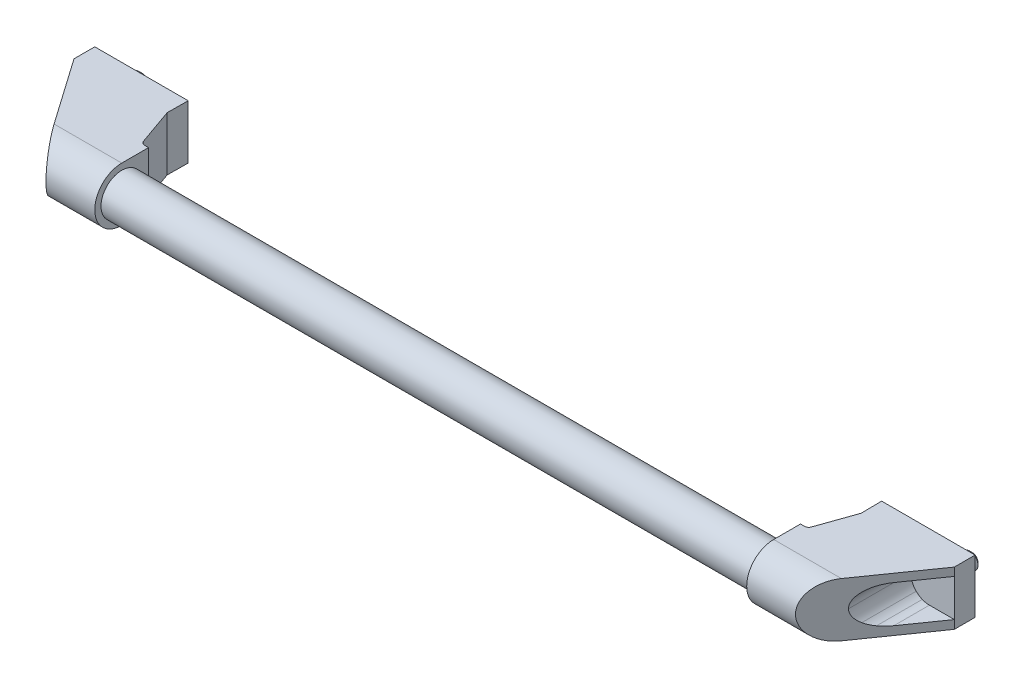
ISO-10303-21;
HEADER;
FILE_DESCRIPTION(('STEP AP214'),'2;1');
FILE_NAME('part.step','',(''),(''),'','','');
FILE_SCHEMA(('AUTOMOTIVE_DESIGN { 1 0 10303 214 1 1 1 1 }'));
ENDSEC;
DATA;
#1=APPLICATION_CONTEXT('core data for automotive mechanical design processes');
#2=APPLICATION_PROTOCOL_DEFINITION('international standard','automotive_design',2000,#1);
#3=PRODUCT_CONTEXT('',#1,'mechanical');
#4=PRODUCT('Part','Part','',(#3));
#5=PRODUCT_RELATED_PRODUCT_CATEGORY('part','',(#4));
#6=PRODUCT_DEFINITION_FORMATION('','',#4);
#7=PRODUCT_DEFINITION_CONTEXT('part definition',#1,'design');
#8=PRODUCT_DEFINITION('design','',#6,#7);
#9=PRODUCT_DEFINITION_SHAPE('','',#8);
#10=(LENGTH_UNIT() NAMED_UNIT(*) SI_UNIT(.MILLI.,.METRE.));
#11=(NAMED_UNIT(*) PLANE_ANGLE_UNIT() SI_UNIT($,.RADIAN.));
#12=(NAMED_UNIT(*) SI_UNIT($,.STERADIAN.) SOLID_ANGLE_UNIT());
#13=UNCERTAINTY_MEASURE_WITH_UNIT(LENGTH_MEASURE(1.E-05),#10,'distance_accuracy_value','');
#14=(GEOMETRIC_REPRESENTATION_CONTEXT(3) GLOBAL_UNCERTAINTY_ASSIGNED_CONTEXT((#13)) GLOBAL_UNIT_ASSIGNED_CONTEXT((#10,
#11,#12)) REPRESENTATION_CONTEXT('',''));
#15=CARTESIAN_POINT('',(0.,0.,0.));
#16=DIRECTION('',(0.,0.,1.));
#17=DIRECTION('',(1.,0.,0.));
#18=AXIS2_PLACEMENT_3D('',#15,#16,#17);
#19=CARTESIAN_POINT('',(43.,0.,42.));
#20=DIRECTION('',(-1.,0.,0.));
#21=DIRECTION('',(0.,1.,0.));
#22=AXIS2_PLACEMENT_3D('',#19,#20,#21);
#23=PLANE('',#22);
#24=DIRECTION('',(0.,1.,0.));
#25=VECTOR('',#24,1.);
#26=CARTESIAN_POINT('',(43.,-13.,29.106429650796));
#27=LINE('',#26,#25);
#28=CARTESIAN_POINT('',(43.,-13.,29.106429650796));
#29=VERTEX_POINT('',#28);
#30=CARTESIAN_POINT('',(43.,13.,29.106429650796));
#31=VERTEX_POINT('',#30);
#32=EDGE_CURVE('E403',#29,#31,#27,.T.);
#33=ORIENTED_EDGE('',*,*,#32,.T.);
#34=DIRECTION('',(0.,0.,-1.));
#35=VECTOR('',#34,1.);
#36=CARTESIAN_POINT('',(43.,13.,42.));
#37=LINE('',#36,#35);
#38=CARTESIAN_POINT('',(43.,13.,42.));
#39=VERTEX_POINT('',#38);
#40=EDGE_CURVE('E427',#39,#31,#37,.T.);
#41=ORIENTED_EDGE('',*,*,#40,.F.);
#42=CARTESIAN_POINT('',(43.,0.,42.));
#43=DIRECTION('',(1.,0.,0.));
#44=DIRECTION('',(0.,1.,0.));
#45=AXIS2_PLACEMENT_3D('',#42,#43,#44);
#46=CIRCLE('',#45,13.);
#47=CARTESIAN_POINT('',(43.,-13.,42.));
#48=VERTEX_POINT('',#47);
#49=EDGE_CURVE('E431',#39,#48,#46,.T.);
#50=ORIENTED_EDGE('',*,*,#49,.T.);
#51=DIRECTION('',(0.,0.,-1.));
#52=VECTOR('',#51,1.);
#53=CARTESIAN_POINT('',(43.,-13.,42.));
#54=LINE('',#53,#52);
#55=EDGE_CURVE('E429',#48,#29,#54,.T.);
#56=ORIENTED_EDGE('',*,*,#55,.T.);
#57=EDGE_LOOP('',(#33,#41,#50,#56));
#58=FACE_BOUND('',#57,.T.);
#59=CARTESIAN_POINT('',(43.,0.,42.));
#60=DIRECTION('',(-1.,0.,0.));
#61=DIRECTION('',(0.,0.,1.));
#62=AXIS2_PLACEMENT_3D('',#59,#60,#61);
#63=CIRCLE('',#62,10.);
#64=CARTESIAN_POINT('',(43.,0.,52.));
#65=VERTEX_POINT('',#64);
#66=EDGE_CURVE('E1272',#65,#65,#63,.T.);
#67=ORIENTED_EDGE('',*,*,#66,.T.);
#68=EDGE_LOOP('',(#67));
#69=FACE_BOUND('',#68,.T.);
#70=ADVANCED_FACE('F14',(#58,#69),#23,.F.);
#71=CARTESIAN_POINT('',(-12.,13.,0.));
#72=DIRECTION('',(0.,0.,-1.));
#73=DIRECTION('',(1.,0.,0.));
#74=AXIS2_PLACEMENT_3D('',#71,#72,#73);
#75=PLANE('',#74);
#76=DIRECTION('',(0.,-1.,0.));
#77=VECTOR('',#76,1.);
#78=CARTESIAN_POINT('',(13.,8.,0.));
#79=LINE('',#78,#77);
#80=CARTESIAN_POINT('',(13.,8.,0.));
#81=VERTEX_POINT('',#80);
#82=CARTESIAN_POINT('',(13.,-8.,0.));
#83=VERTEX_POINT('',#82);
#84=EDGE_CURVE('E318',#81,#83,#79,.T.);
#85=ORIENTED_EDGE('',*,*,#84,.T.);
#86=DIRECTION('',(-1.,0.,0.));
#87=VECTOR('',#86,1.);
#88=CARTESIAN_POINT('',(28.,-8.,0.));
#89=LINE('',#88,#87);
#90=CARTESIAN_POINT('',(28.,-8.,0.));
#91=VERTEX_POINT('',#90);
#92=EDGE_CURVE('E305',#91,#83,#89,.T.);
#93=ORIENTED_EDGE('',*,*,#92,.F.);
#94=DIRECTION('',(0.,1.,0.));
#95=VECTOR('',#94,1.);
#96=CARTESIAN_POINT('',(28.,-8.,0.));
#97=LINE('',#96,#95);
#98=CARTESIAN_POINT('',(28.,8.,0.));
#99=VERTEX_POINT('',#98);
#100=EDGE_CURVE('E287',#91,#99,#97,.T.);
#101=ORIENTED_EDGE('',*,*,#100,.T.);
#102=DIRECTION('',(1.,0.,0.));
#103=VECTOR('',#102,1.);
#104=CARTESIAN_POINT('',(13.,8.,0.));
#105=LINE('',#104,#103);
#106=EDGE_CURVE('E302',#81,#99,#105,.T.);
#107=ORIENTED_EDGE('',*,*,#106,.F.);
#108=EDGE_LOOP('',(#85,#93,#101,#107));
#109=FACE_BOUND('',#108,.T.);
#110=DIRECTION('',(0.,1.,0.));
#111=VECTOR('',#110,1.);
#112=CARTESIAN_POINT('',(33.,-13.,0.));
#113=LINE('',#112,#111);
#114=CARTESIAN_POINT('',(33.,-13.,0.));
#115=VERTEX_POINT('',#114);
#116=CARTESIAN_POINT('',(33.,13.,0.));
#117=VERTEX_POINT('',#116);
#118=EDGE_CURVE('E412',#115,#117,#113,.T.);
#119=ORIENTED_EDGE('',*,*,#118,.F.);
#120=DIRECTION('',(1.,0.,0.));
#121=VECTOR('',#120,1.);
#122=CARTESIAN_POINT('',(-12.,-13.,0.));
#123=LINE('',#122,#121);
#124=CARTESIAN_POINT('',(-12.,-13.,0.));
#125=VERTEX_POINT('',#124);
#126=EDGE_CURVE('E444',#125,#115,#123,.T.);
#127=ORIENTED_EDGE('',*,*,#126,.F.);
#128=DIRECTION('',(0.,-1.,0.));
#129=VECTOR('',#128,1.);
#130=CARTESIAN_POINT('',(-12.,13.,0.));
#131=LINE('',#130,#129);
#132=CARTESIAN_POINT('',(-12.,13.,0.));
#133=VERTEX_POINT('',#132);
#134=EDGE_CURVE('E436',#133,#125,#131,.T.);
#135=ORIENTED_EDGE('',*,*,#134,.F.);
#136=DIRECTION('',(1.,0.,0.));
#137=VECTOR('',#136,1.);
#138=CARTESIAN_POINT('',(-12.,13.,0.));
#139=LINE('',#138,#137);
#140=EDGE_CURVE('E441',#133,#117,#139,.T.);
#141=ORIENTED_EDGE('',*,*,#140,.T.);
#142=EDGE_LOOP('',(#119,#127,#135,#141));
#143=FACE_BOUND('',#142,.T.);
#144=CARTESIAN_POINT('',(0.,0.,0.));
#145=DIRECTION('',(0.,0.,-1.));
#146=DIRECTION('',(-1.,0.,0.));
#147=AXIS2_PLACEMENT_3D('',#144,#145,#146);
#148=CIRCLE('',#147,4.);
#149=CARTESIAN_POINT('',(-4.,0.,0.));
#150=VERTEX_POINT('',#149);
#151=EDGE_CURVE('E1266',#150,#150,#148,.T.);
#152=ORIENTED_EDGE('',*,*,#151,.F.);
#153=EDGE_LOOP('',(#152));
#154=FACE_BOUND('',#153,.T.);
#155=ADVANCED_FACE('F300',(#109,#143,#154),#75,.T.);
#156=CARTESIAN_POINT('',(-12.,-13.,10.));
#157=DIRECTION('',(0.819152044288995,0.,-0.573576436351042));
#158=DIRECTION('',(0.573576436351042,0.,0.819152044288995));
#159=AXIS2_PLACEMENT_3D('',#156,#157,#158);
#160=PLANE('',#159);
#161=DIRECTION('',(-0.573576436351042,0.,-0.819152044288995));
#162=VECTOR('',#161,1.);
#163=CARTESIAN_POINT('',(-12.,-8.90119415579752,10.));
#164=LINE('',#163,#162);
#165=CARTESIAN_POINT('',(7.15225756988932E-06,-8.90119415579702,27.1377862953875));
#166=VERTEX_POINT('',#165);
#167=CARTESIAN_POINT('',(-12.,-8.90119415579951,10.));
#168=VERTEX_POINT('',#167);
#169=EDGE_CURVE('E472',#166,#168,#164,.T.);
#170=ORIENTED_EDGE('',*,*,#169,.T.);
#171=DIRECTION('',(0.,1.,0.));
#172=VECTOR('',#171,1.);
#173=CARTESIAN_POINT('',(-12.,-13.,10.));
#174=LINE('',#173,#172);
#175=CARTESIAN_POINT('',(-12.,-13.,10.));
#176=VERTEX_POINT('',#175);
#177=EDGE_CURVE('E422',#176,#168,#174,.T.);
#178=ORIENTED_EDGE('',*,*,#177,.F.);
#179=DIRECTION('',(0.573576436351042,0.,0.819152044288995));
#180=VECTOR('',#179,1.);
#181=CARTESIAN_POINT('',(-12.,-13.,10.));
#182=LINE('',#181,#180);
#183=CARTESIAN_POINT('',(10.4066412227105,-13.,42.));
#184=VERTEX_POINT('',#183);
#185=EDGE_CURVE('E418',#176,#184,#182,.T.);
#186=ORIENTED_EDGE('',*,*,#185,.T.);
#187=CARTESIAN_POINT('',(10.4066412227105,0.,42.));
#188=DIRECTION('',(-0.819152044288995,0.,0.573576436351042));
#189=DIRECTION('',(0.573576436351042,0.,0.819152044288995));
#190=AXIS2_PLACEMENT_3D('',#187,#188,#189);
#191=ELLIPSE('',#190,15.8700696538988,13.);
#192=CARTESIAN_POINT('',(10.4066412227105,13.,42.));
#193=VERTEX_POINT('',#192);
#194=EDGE_CURVE('E425',#184,#193,#191,.T.);
#195=ORIENTED_EDGE('',*,*,#194,.T.);
#196=DIRECTION('',(0.573576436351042,0.,0.819152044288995));
#197=VECTOR('',#196,1.);
#198=CARTESIAN_POINT('',(-12.,13.,10.));
#199=LINE('',#198,#197);
#200=CARTESIAN_POINT('',(-12.,13.,10.));
#201=VERTEX_POINT('',#200);
#202=EDGE_CURVE('E415',#201,#193,#199,.T.);
#203=ORIENTED_EDGE('',*,*,#202,.F.);
#204=CARTESIAN_POINT('',(-12.,9.09880893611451,10.));
#205=VERTEX_POINT('',#204);
#206=EDGE_CURVE('E421',#205,#201,#174,.T.);
#207=ORIENTED_EDGE('',*,*,#206,.F.);
#208=DIRECTION('',(-0.573576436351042,0.,-0.819152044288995));
#209=VECTOR('',#208,1.);
#210=CARTESIAN_POINT('',(-12.,9.09880893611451,10.));
#211=LINE('',#210,#209);
#212=CARTESIAN_POINT('',(0.,9.09880893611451,27.1377760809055));
#213=VERTEX_POINT('',#212);
#214=EDGE_CURVE('E451',#213,#205,#211,.T.);
#215=ORIENTED_EDGE('',*,*,#214,.F.);
#216=CARTESIAN_POINT('',(-6.61501399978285E-06,0.098772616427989,27.1377666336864));
#217=DIRECTION('',(-0.819152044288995,0.,0.573576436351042));
#218=DIRECTION('',(0.573576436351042,0.,0.819152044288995));
#219=AXIS2_PLACEMENT_3D('',#216,#217,#218);
#220=ELLIPSE('',#219,15.691084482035,9.0000363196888);
#221=CARTESIAN_POINT('',(3.444151,8.4137249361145,32.0565334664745));
#222=VERTEX_POINT('',#221);
#223=EDGE_CURVE('E454',#222,#213,#220,.T.);
#224=ORIENTED_EDGE('',*,*,#223,.F.);
#225=CARTESIAN_POINT('',(-2.10368269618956E-05,0.0987787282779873,27.137746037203));
#226=DIRECTION('',(-0.819152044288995,0.,0.573576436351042));
#227=DIRECTION('',(0.573576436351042,0.,0.819152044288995));
#228=AXIS2_PLACEMENT_3D('',#225,#226,#227);
#229=ELLIPSE('',#228,15.6910842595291,9.00003619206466);
#230=CARTESIAN_POINT('',(6.363961,6.4627699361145,36.22645429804));
#231=VERTEX_POINT('',#230);
#232=EDGE_CURVE('E457',#231,#222,#229,.T.);
#233=ORIENTED_EDGE('',*,*,#232,.F.);
#234=CARTESIAN_POINT('',(-3.07078365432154E-05,0.098790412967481,27.13773222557));
#235=DIRECTION('',(-0.819152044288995,0.,0.573576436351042));
#236=DIRECTION('',(0.573576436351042,0.,0.819152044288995));
#237=AXIS2_PLACEMENT_3D('',#234,#235,#236);
#238=ELLIPSE('',#237,15.6910817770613,9.00003476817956);
#239=CARTESIAN_POINT('',(9.00000406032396,0.0988089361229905,39.9911139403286));
#240=VERTEX_POINT('',#239);
#241=EDGE_CURVE('E460',#240,#231,#238,.T.);
#242=ORIENTED_EDGE('',*,*,#241,.F.);
#243=CARTESIAN_POINT('',(-3.27593625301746E-05,0.0988180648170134,27.1377292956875));
#244=DIRECTION('',(-0.819152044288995,0.,0.573576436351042));
#245=DIRECTION('',(0.573576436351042,0.,0.819152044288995));
#246=AXIS2_PLACEMENT_3D('',#243,#244,#245);
#247=ELLIPSE('',#246,15.6910853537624,9.00003681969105);
#248=CARTESIAN_POINT('',(6.36396815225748,-6.26515515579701,36.2264645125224));
#249=VERTEX_POINT('',#248);
#250=EDGE_CURVE('E463',#249,#240,#247,.T.);
#251=ORIENTED_EDGE('',*,*,#250,.F.);
#252=CARTESIAN_POINT('',(-1.38845695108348E-05,0.0988360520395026,27.1377562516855));
#253=DIRECTION('',(-0.819152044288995,0.,0.573576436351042));
#254=DIRECTION('',(0.573576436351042,0.,0.819152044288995));
#255=AXIS2_PLACEMENT_3D('',#252,#253,#254);
#256=ELLIPSE('',#255,15.6910842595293,9.00003619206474);
#257=CARTESIAN_POINT('',(3.44415815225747,-8.21611015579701,32.0565436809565));
#258=VERTEX_POINT('',#257);
#259=EDGE_CURVE('E466',#258,#249,#256,.T.);
#260=ORIENTED_EDGE('',*,*,#259,.F.);
#261=CARTESIAN_POINT('',(5.37242955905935E-07,0.0988421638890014,27.1377768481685));
#262=DIRECTION('',(-0.819152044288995,0.,0.573576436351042));
#263=DIRECTION('',(0.573576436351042,0.,0.819152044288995));
#264=AXIS2_PLACEMENT_3D('',#261,#262,#263);
#265=ELLIPSE('',#264,15.6910844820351,9.00003631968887);
#266=EDGE_CURVE('E469',#166,#258,#265,.T.);
#267=ORIENTED_EDGE('',*,*,#266,.F.);
#268=EDGE_LOOP('',(#170,#178,#186,#195,#203,#207,#215,#224,#233,#242,#251,#260,#267));
#269=FACE_BOUND('',#268,.T.);
#270=ADVANCED_FACE('F731',(#269),#160,.F.);
#271=CARTESIAN_POINT('',(-12.,13.,42.));
#272=DIRECTION('',(0.,1.,0.));
#273=DIRECTION('',(1.,0.,0.));
#274=AXIS2_PLACEMENT_3D('',#271,#272,#273);
#275=PLANE('',#274);
#276=DIRECTION('',(0.0104830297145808,0.,-0.999945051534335));
#277=VECTOR('',#276,1.);
#278=CARTESIAN_POINT('',(32.895169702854,13.,9.99945051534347));
#279=LINE('',#278,#277);
#280=CARTESIAN_POINT('',(32.895169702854,13.,9.99945051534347));
#281=VERTEX_POINT('',#280);
#282=EDGE_CURVE('E389',#281,#117,#279,.T.);
#283=ORIENTED_EDGE('',*,*,#282,.T.);
#284=ORIENTED_EDGE('',*,*,#140,.F.);
#285=DIRECTION('',(0.,0.,-1.));
#286=VECTOR('',#285,1.);
#287=CARTESIAN_POINT('',(-12.,13.,42.));
#288=LINE('',#287,#286);
#289=EDGE_CURVE('E434',#201,#133,#288,.T.);
#290=ORIENTED_EDGE('',*,*,#289,.F.);
#291=ORIENTED_EDGE('',*,*,#202,.T.);
#292=DIRECTION('',(1.,0.,0.));
#293=VECTOR('',#292,1.);
#294=CARTESIAN_POINT('',(-12.,13.,42.));
#295=LINE('',#294,#293);
#296=EDGE_CURVE('E449',#193,#39,#295,.T.);
#297=ORIENTED_EDGE('',*,*,#296,.T.);
#298=ORIENTED_EDGE('',*,*,#40,.T.);
#299=DIRECTION('',(-0.999945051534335,0.,-0.0104830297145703));
#300=VECTOR('',#299,1.);
#301=CARTESIAN_POINT('',(43.,13.,29.106429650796));
#302=LINE('',#301,#300);
#303=CARTESIAN_POINT('',(41.0113841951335,13.,29.0855817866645));
#304=VERTEX_POINT('',#303);
#305=EDGE_CURVE('E380',#31,#304,#302,.T.);
#306=ORIENTED_EDGE('',*,*,#305,.T.);
#307=CARTESIAN_POINT('',(41.032350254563,13.,27.085691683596));
#308=DIRECTION('',(0.,-1.,0.));
#309=DIRECTION('',(1.,0.,0.));
#310=AXIS2_PLACEMENT_3D('',#307,#308,#309);
#311=CIRCLE('',#310,2.);
#312=CARTESIAN_POINT('',(39.1458974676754,13.,27.7499927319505));
#313=VERTEX_POINT('',#312);
#314=EDGE_CURVE('E383',#304,#313,#311,.T.);
#315=ORIENTED_EDGE('',*,*,#314,.T.);
#316=DIRECTION('',(0.332150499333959,0.,0.943226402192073));
#317=VECTOR('',#316,1.);
#318=CARTESIAN_POINT('',(32.895169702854,13.,9.99945051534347));
#319=LINE('',#318,#317);
#320=EDGE_CURVE('E386',#281,#313,#319,.T.);
#321=ORIENTED_EDGE('',*,*,#320,.F.);
#322=EDGE_LOOP('',(#283,#284,#290,#291,#297,#298,#306,#315,#321));
#323=FACE_BOUND('',#322,.T.);
#324=ADVANCED_FACE('F743',(#323),#275,.T.);
#325=CARTESIAN_POINT('',(-12.,0.,42.));
#326=DIRECTION('',(1.,0.,0.));
#327=DIRECTION('',(0.,-1.,0.));
#328=AXIS2_PLACEMENT_3D('',#325,#326,#327);
#329=CYLINDRICAL_SURFACE('',#328,13.);
#330=ORIENTED_EDGE('',*,*,#194,.F.);
#331=DIRECTION('',(1.,0.,0.));
#332=VECTOR('',#331,1.);
#333=CARTESIAN_POINT('',(-12.,-13.,42.));
#334=LINE('',#333,#332);
#335=EDGE_CURVE('E447',#184,#48,#334,.T.);
#336=ORIENTED_EDGE('',*,*,#335,.T.);
#337=ORIENTED_EDGE('',*,*,#49,.F.);
#338=ORIENTED_EDGE('',*,*,#296,.F.);
#339=EDGE_LOOP('',(#330,#336,#337,#338));
#340=FACE_BOUND('',#339,.T.);
#341=ADVANCED_FACE('F745',(#340),#329,.T.);
#342=CARTESIAN_POINT('',(-12.,-13.,42.));
#343=DIRECTION('',(0.,1.,0.));
#344=DIRECTION('',(1.,0.,0.));
#345=AXIS2_PLACEMENT_3D('',#342,#343,#344);
#346=PLANE('',#345);
#347=DIRECTION('',(0.332150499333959,0.,0.943226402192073));
#348=VECTOR('',#347,1.);
#349=CARTESIAN_POINT('',(32.895169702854,-13.,9.99945051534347));
#350=LINE('',#349,#348);
#351=CARTESIAN_POINT('',(32.895169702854,-13.,9.99945051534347));
#352=VERTEX_POINT('',#351);
#353=CARTESIAN_POINT('',(39.1458974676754,-13.,27.7499927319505));
#354=VERTEX_POINT('',#353);
#355=EDGE_CURVE('E397',#352,#354,#350,.T.);
#356=ORIENTED_EDGE('',*,*,#355,.T.);
#357=CARTESIAN_POINT('',(41.032350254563,-13.,27.085691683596));
#358=DIRECTION('',(0.,-1.,0.));
#359=DIRECTION('',(1.,0.,0.));
#360=AXIS2_PLACEMENT_3D('',#357,#358,#359);
#361=CIRCLE('',#360,2.);
#362=CARTESIAN_POINT('',(41.0113841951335,-13.,29.0855817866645));
#363=VERTEX_POINT('',#362);
#364=EDGE_CURVE('E394',#363,#354,#361,.T.);
#365=ORIENTED_EDGE('',*,*,#364,.F.);
#366=DIRECTION('',(-0.999945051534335,0.,-0.0104830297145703));
#367=VECTOR('',#366,1.);
#368=CARTESIAN_POINT('',(43.,-13.,29.106429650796));
#369=LINE('',#368,#367);
#370=EDGE_CURVE('E391',#29,#363,#369,.T.);
#371=ORIENTED_EDGE('',*,*,#370,.F.);
#372=ORIENTED_EDGE('',*,*,#55,.F.);
#373=ORIENTED_EDGE('',*,*,#335,.F.);
#374=ORIENTED_EDGE('',*,*,#185,.F.);
#375=DIRECTION('',(0.,0.,-1.));
#376=VECTOR('',#375,1.);
#377=CARTESIAN_POINT('',(-12.,-13.,42.));
#378=LINE('',#377,#376);
#379=EDGE_CURVE('E439',#176,#125,#378,.T.);
#380=ORIENTED_EDGE('',*,*,#379,.T.);
#381=ORIENTED_EDGE('',*,*,#126,.T.);
#382=DIRECTION('',(0.0104830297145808,0.,-0.999945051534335));
#383=VECTOR('',#382,1.);
#384=CARTESIAN_POINT('',(32.895169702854,-13.,9.99945051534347));
#385=LINE('',#384,#383);
#386=EDGE_CURVE('E400',#352,#115,#385,.T.);
#387=ORIENTED_EDGE('',*,*,#386,.F.);
#388=EDGE_LOOP('',(#356,#365,#371,#372,#373,#374,#380,#381,#387));
#389=FACE_BOUND('',#388,.T.);
#390=ADVANCED_FACE('F741',(#389),#346,.F.);
#391=CARTESIAN_POINT('',(-12.,0.,42.));
#392=DIRECTION('',(-1.,0.,0.));
#393=DIRECTION('',(0.,1.,0.));
#394=AXIS2_PLACEMENT_3D('',#391,#392,#393);
#395=PLANE('',#394);
#396=ORIENTED_EDGE('',*,*,#177,.T.);
#397=DIRECTION('',(0.,1.,0.));
#398=VECTOR('',#397,1.);
#399=CARTESIAN_POINT('',(-12.,-8.90119415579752,10.));
#400=LINE('',#399,#398);
#401=EDGE_CURVE('E356',#168,#205,#400,.T.);
#402=ORIENTED_EDGE('',*,*,#401,.T.);
#403=ORIENTED_EDGE('',*,*,#206,.T.);
#404=ORIENTED_EDGE('',*,*,#289,.T.);
#405=ORIENTED_EDGE('',*,*,#134,.T.);
#406=ORIENTED_EDGE('',*,*,#379,.F.);
#407=EDGE_LOOP('',(#396,#402,#403,#404,#405,#406));
#408=FACE_BOUND('',#407,.T.);
#409=ADVANCED_FACE('F737',(#408),#395,.T.);
#410=CARTESIAN_POINT('',(32.895169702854,-13.,9.99945051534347));
#411=DIRECTION('',(-0.999945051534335,0.,-0.0104830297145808));
#412=DIRECTION('',(0.0104830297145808,0.,-0.999945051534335));
#413=AXIS2_PLACEMENT_3D('',#410,#411,#412);
#414=PLANE('',#413);
#415=DIRECTION('',(0.,1.,0.));
#416=VECTOR('',#415,1.);
#417=CARTESIAN_POINT('',(32.895169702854,-13.,9.99945051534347));
#418=LINE('',#417,#416);
#419=EDGE_CURVE('E410',#352,#281,#418,.T.);
#420=ORIENTED_EDGE('',*,*,#419,.F.);
#421=ORIENTED_EDGE('',*,*,#386,.T.);
#422=ORIENTED_EDGE('',*,*,#118,.T.);
#423=ORIENTED_EDGE('',*,*,#282,.F.);
#424=EDGE_LOOP('',(#420,#421,#422,#423));
#425=FACE_BOUND('',#424,.T.);
#426=ADVANCED_FACE('F740',(#425),#414,.F.);
#427=CARTESIAN_POINT('',(32.895169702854,-13.,9.99945051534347));
#428=DIRECTION('',(0.943226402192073,0.,-0.332150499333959));
#429=DIRECTION('',(0.332150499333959,0.,0.943226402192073));
#430=AXIS2_PLACEMENT_3D('',#427,#428,#429);
#431=PLANE('',#430);
#432=DIRECTION('',(0.,1.,0.));
#433=VECTOR('',#432,1.);
#434=CARTESIAN_POINT('',(39.1458974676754,-13.,27.7499927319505));
#435=LINE('',#434,#433);
#436=EDGE_CURVE('E408',#354,#313,#435,.T.);
#437=ORIENTED_EDGE('',*,*,#436,.F.);
#438=ORIENTED_EDGE('',*,*,#355,.F.);
#439=ORIENTED_EDGE('',*,*,#419,.T.);
#440=ORIENTED_EDGE('',*,*,#320,.T.);
#441=EDGE_LOOP('',(#437,#438,#439,#440));
#442=FACE_BOUND('',#441,.T.);
#443=ADVANCED_FACE('F1209',(#442),#431,.T.);
#444=CARTESIAN_POINT('',(41.032350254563,-13.,27.085691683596));
#445=DIRECTION('',(0.,1.,0.));
#446=DIRECTION('',(1.,0.,0.));
#447=AXIS2_PLACEMENT_3D('',#444,#445,#446);
#448=CYLINDRICAL_SURFACE('',#447,2.);
#449=DIRECTION('',(0.,1.,0.));
#450=VECTOR('',#449,1.);
#451=CARTESIAN_POINT('',(41.0113841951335,-13.,29.0855817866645));
#452=LINE('',#451,#450);
#453=EDGE_CURVE('E406',#363,#304,#452,.T.);
#454=ORIENTED_EDGE('',*,*,#453,.F.);
#455=ORIENTED_EDGE('',*,*,#364,.T.);
#456=ORIENTED_EDGE('',*,*,#436,.T.);
#457=ORIENTED_EDGE('',*,*,#314,.F.);
#458=EDGE_LOOP('',(#454,#455,#456,#457));
#459=FACE_BOUND('',#458,.T.);
#460=ADVANCED_FACE('F1200',(#459),#448,.F.);
#461=CARTESIAN_POINT('',(43.,-13.,29.106429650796));
#462=DIRECTION('',(-0.0104830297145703,0.,0.999945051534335));
#463=DIRECTION('',(-0.999945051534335,0.,-0.0104830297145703));
#464=AXIS2_PLACEMENT_3D('',#461,#462,#463);
#465=PLANE('',#464);
#466=ORIENTED_EDGE('',*,*,#32,.F.);
#467=ORIENTED_EDGE('',*,*,#370,.T.);
#468=ORIENTED_EDGE('',*,*,#453,.T.);
#469=ORIENTED_EDGE('',*,*,#305,.F.);
#470=EDGE_LOOP('',(#466,#467,#468,#469));
#471=FACE_BOUND('',#470,.T.);
#472=ADVANCED_FACE('F1191',(#471),#465,.F.);
#473=CARTESIAN_POINT('',(-12.,-8.90119415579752,10.));
#474=DIRECTION('',(0.,1.,0.));
#475=DIRECTION('',(1.,0.,0.));
#476=AXIS2_PLACEMENT_3D('',#473,#474,#475);
#477=PLANE('',#476);
#478=ORIENTED_EDGE('',*,*,#169,.F.);
#479=DIRECTION('',(0.,0.,1.));
#480=VECTOR('',#479,1.);
#481=CARTESIAN_POINT('',(7.15225755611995E-06,-8.90119415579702,10.));
#482=LINE('',#481,#480);
#483=CARTESIAN_POINT('',(7.15225755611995E-06,-8.90119415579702,10.));
#484=VERTEX_POINT('',#483);
#485=EDGE_CURVE('E377',#484,#166,#482,.T.);
#486=ORIENTED_EDGE('',*,*,#485,.F.);
#487=DIRECTION('',(1.,0.,0.));
#488=VECTOR('',#487,1.);
#489=CARTESIAN_POINT('',(-12.,-8.90119415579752,10.));
#490=LINE('',#489,#488);
#491=EDGE_CURVE('E294',#168,#484,#490,.T.);
#492=ORIENTED_EDGE('',*,*,#491,.F.);
#493=EDGE_LOOP('',(#478,#486,#492));
#494=FACE_BOUND('',#493,.T.);
#495=ADVANCED_FACE('F1182',(#494),#477,.T.);
#496=CARTESIAN_POINT('',(5.37242966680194E-07,0.0988421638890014,10.));
#497=DIRECTION('',(0.,0.,1.));
#498=DIRECTION('',(-1.,0.,0.));
#499=AXIS2_PLACEMENT_3D('',#496,#497,#498);
#500=CYLINDRICAL_SURFACE('',#499,9.00003631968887);
#501=ORIENTED_EDGE('',*,*,#485,.T.);
#502=ORIENTED_EDGE('',*,*,#266,.T.);
#503=DIRECTION('',(0.,0.,1.));
#504=VECTOR('',#503,1.);
#505=CARTESIAN_POINT('',(3.44415815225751,-8.21611015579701,10.));
#506=LINE('',#505,#504);
#507=CARTESIAN_POINT('',(3.44415815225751,-8.21611015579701,10.));
#508=VERTEX_POINT('',#507);
#509=EDGE_CURVE('E374',#508,#258,#506,.T.);
#510=ORIENTED_EDGE('',*,*,#509,.F.);
#511=CARTESIAN_POINT('',(5.37242966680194E-07,0.0988421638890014,10.));
#512=DIRECTION('',(0.,0.,-1.));
#513=DIRECTION('',(-1.,0.,0.));
#514=AXIS2_PLACEMENT_3D('',#511,#512,#513);
#515=CIRCLE('',#514,9.00003631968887);
#516=EDGE_CURVE('E335',#508,#484,#515,.T.);
#517=ORIENTED_EDGE('',*,*,#516,.T.);
#518=EDGE_LOOP('',(#501,#502,#510,#517));
#519=FACE_BOUND('',#518,.T.);
#520=ADVANCED_FACE('F1173',(#519),#500,.F.);
#521=CARTESIAN_POINT('',(-1.3884569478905E-05,0.0988360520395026,10.));
#522=DIRECTION('',(0.,0.,1.));
#523=DIRECTION('',(-1.,0.,0.));
#524=AXIS2_PLACEMENT_3D('',#521,#522,#523);
#525=CYLINDRICAL_SURFACE('',#524,9.00003619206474);
#526=ORIENTED_EDGE('',*,*,#509,.T.);
#527=ORIENTED_EDGE('',*,*,#259,.T.);
#528=DIRECTION('',(0.,0.,1.));
#529=VECTOR('',#528,1.);
#530=CARTESIAN_POINT('',(6.36396815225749,-6.26515515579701,10.));
#531=LINE('',#530,#529);
#532=CARTESIAN_POINT('',(6.36396815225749,-6.26515515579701,10.));
#533=VERTEX_POINT('',#532);
#534=EDGE_CURVE('E371',#533,#249,#531,.T.);
#535=ORIENTED_EDGE('',*,*,#534,.F.);
#536=CARTESIAN_POINT('',(-1.3884569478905E-05,0.0988360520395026,10.));
#537=DIRECTION('',(0.,0.,-1.));
#538=DIRECTION('',(-1.,0.,0.));
#539=AXIS2_PLACEMENT_3D('',#536,#537,#538);
#540=CIRCLE('',#539,9.00003619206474);
#541=EDGE_CURVE('E338',#533,#508,#540,.T.);
#542=ORIENTED_EDGE('',*,*,#541,.T.);
#543=EDGE_LOOP('',(#526,#527,#535,#542));
#544=FACE_BOUND('',#543,.T.);
#545=ADVANCED_FACE('F1164',(#544),#525,.F.);
#546=CARTESIAN_POINT('',(-3.27593625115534E-05,0.0988180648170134,10.));
#547=DIRECTION('',(0.,0.,1.));
#548=DIRECTION('',(-1.,0.,0.));
#549=AXIS2_PLACEMENT_3D('',#546,#547,#548);
#550=CYLINDRICAL_SURFACE('',#549,9.00003681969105);
#551=ORIENTED_EDGE('',*,*,#534,.T.);
#552=ORIENTED_EDGE('',*,*,#250,.T.);
#553=DIRECTION('',(0.,0.,1.));
#554=VECTOR('',#553,1.);
#555=CARTESIAN_POINT('',(9.00000406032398,0.0988089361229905,10.));
#556=LINE('',#555,#554);
#557=CARTESIAN_POINT('',(9.00000406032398,0.0988089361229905,10.));
#558=VERTEX_POINT('',#557);
#559=EDGE_CURVE('E368',#558,#240,#556,.T.);
#560=ORIENTED_EDGE('',*,*,#559,.F.);
#561=CARTESIAN_POINT('',(-3.27593625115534E-05,0.0988180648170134,10.));
#562=DIRECTION('',(0.,0.,-1.));
#563=DIRECTION('',(-1.,0.,0.));
#564=AXIS2_PLACEMENT_3D('',#561,#562,#563);
#565=CIRCLE('',#564,9.00003681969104);
#566=EDGE_CURVE('E341',#558,#533,#565,.T.);
#567=ORIENTED_EDGE('',*,*,#566,.T.);
#568=EDGE_LOOP('',(#551,#552,#560,#567));
#569=FACE_BOUND('',#568,.T.);
#570=ADVANCED_FACE('F1155',(#569),#550,.F.);
#571=CARTESIAN_POINT('',(-3.07078365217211E-05,0.098790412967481,10.));
#572=DIRECTION('',(0.,0.,1.));
#573=DIRECTION('',(-1.,0.,0.));
#574=AXIS2_PLACEMENT_3D('',#571,#572,#573);
#575=CYLINDRICAL_SURFACE('',#574,9.00003476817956);
#576=ORIENTED_EDGE('',*,*,#559,.T.);
#577=ORIENTED_EDGE('',*,*,#241,.T.);
#578=DIRECTION('',(0.,0.,1.));
#579=VECTOR('',#578,1.);
#580=CARTESIAN_POINT('',(6.363961,6.4627699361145,10.));
#581=LINE('',#580,#579);
#582=CARTESIAN_POINT('',(6.363961,6.4627699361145,10.));
#583=VERTEX_POINT('',#582);
#584=EDGE_CURVE('E365',#583,#231,#581,.T.);
#585=ORIENTED_EDGE('',*,*,#584,.F.);
#586=CARTESIAN_POINT('',(-3.07078365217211E-05,0.098790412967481,10.));
#587=DIRECTION('',(0.,0.,-1.));
#588=DIRECTION('',(-1.,0.,0.));
#589=AXIS2_PLACEMENT_3D('',#586,#587,#588);
#590=CIRCLE('',#589,9.00003476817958);
#591=EDGE_CURVE('E344',#583,#558,#590,.T.);
#592=ORIENTED_EDGE('',*,*,#591,.T.);
#593=EDGE_LOOP('',(#576,#577,#585,#592));
#594=FACE_BOUND('',#593,.T.);
#595=ADVANCED_FACE('F1146',(#594),#575,.F.);
#596=CARTESIAN_POINT('',(-2.10368269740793E-05,0.0987787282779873,10.));
#597=DIRECTION('',(0.,0.,1.));
#598=DIRECTION('',(-1.,0.,0.));
#599=AXIS2_PLACEMENT_3D('',#596,#597,#598);
#600=CYLINDRICAL_SURFACE('',#599,9.00003619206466);
#601=ORIENTED_EDGE('',*,*,#584,.T.);
#602=ORIENTED_EDGE('',*,*,#232,.T.);
#603=DIRECTION('',(0.,0.,1.));
#604=VECTOR('',#603,1.);
#605=CARTESIAN_POINT('',(3.444151,8.4137249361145,10.));
#606=LINE('',#605,#604);
#607=CARTESIAN_POINT('',(3.444151,8.4137249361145,10.));
#608=VERTEX_POINT('',#607);
#609=EDGE_CURVE('E362',#608,#222,#606,.T.);
#610=ORIENTED_EDGE('',*,*,#609,.F.);
#611=CARTESIAN_POINT('',(-2.10368269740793E-05,0.0987787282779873,10.));
#612=DIRECTION('',(0.,0.,-1.));
#613=DIRECTION('',(-1.,0.,0.));
#614=AXIS2_PLACEMENT_3D('',#611,#612,#613);
#615=CIRCLE('',#614,9.00003619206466);
#616=EDGE_CURVE('E347',#608,#583,#615,.T.);
#617=ORIENTED_EDGE('',*,*,#616,.T.);
#618=EDGE_LOOP('',(#601,#602,#610,#617));
#619=FACE_BOUND('',#618,.T.);
#620=ADVANCED_FACE('F1137',(#619),#600,.F.);
#621=CARTESIAN_POINT('',(-6.61501397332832E-06,0.098772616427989,10.));
#622=DIRECTION('',(0.,0.,1.));
#623=DIRECTION('',(-1.,0.,0.));
#624=AXIS2_PLACEMENT_3D('',#621,#622,#623);
#625=CYLINDRICAL_SURFACE('',#624,9.0000363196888);
#626=ORIENTED_EDGE('',*,*,#609,.T.);
#627=ORIENTED_EDGE('',*,*,#223,.T.);
#628=DIRECTION('',(0.,0.,1.));
#629=VECTOR('',#628,1.);
#630=CARTESIAN_POINT('',(0.,9.09880893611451,10.));
#631=LINE('',#630,#629);
#632=CARTESIAN_POINT('',(0.,9.09880893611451,10.));
#633=VERTEX_POINT('',#632);
#634=EDGE_CURVE('E359',#633,#213,#631,.T.);
#635=ORIENTED_EDGE('',*,*,#634,.F.);
#636=CARTESIAN_POINT('',(-6.61501397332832E-06,0.098772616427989,10.));
#637=DIRECTION('',(0.,0.,-1.));
#638=DIRECTION('',(-1.,0.,0.));
#639=AXIS2_PLACEMENT_3D('',#636,#637,#638);
#640=CIRCLE('',#639,9.0000363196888);
#641=EDGE_CURVE('E350',#633,#608,#640,.T.);
#642=ORIENTED_EDGE('',*,*,#641,.T.);
#643=EDGE_LOOP('',(#626,#627,#635,#642));
#644=FACE_BOUND('',#643,.T.);
#645=ADVANCED_FACE('F1128',(#644),#625,.F.);
#646=CARTESIAN_POINT('',(-12.,9.09880893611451,10.));
#647=DIRECTION('',(0.,1.,0.));
#648=DIRECTION('',(1.,0.,0.));
#649=AXIS2_PLACEMENT_3D('',#646,#647,#648);
#650=PLANE('',#649);
#651=ORIENTED_EDGE('',*,*,#634,.T.);
#652=ORIENTED_EDGE('',*,*,#214,.T.);
#653=DIRECTION('',(1.,0.,0.));
#654=VECTOR('',#653,1.);
#655=CARTESIAN_POINT('',(-12.,9.09880893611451,10.));
#656=LINE('',#655,#654);
#657=EDGE_CURVE('E353',#205,#633,#656,.T.);
#658=ORIENTED_EDGE('',*,*,#657,.T.);
#659=EDGE_LOOP('',(#651,#652,#658));
#660=FACE_BOUND('',#659,.T.);
#661=ADVANCED_FACE('F1119',(#660),#650,.F.);
#662=CARTESIAN_POINT('',(5.37242966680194E-07,0.0988421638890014,10.));
#663=DIRECTION('',(0.,0.,1.));
#664=DIRECTION('',(-1.,0.,0.));
#665=AXIS2_PLACEMENT_3D('',#662,#663,#664);
#666=PLANE('',#665);
#667=ORIENTED_EDGE('',*,*,#491,.T.);
#668=ORIENTED_EDGE('',*,*,#516,.F.);
#669=ORIENTED_EDGE('',*,*,#541,.F.);
#670=ORIENTED_EDGE('',*,*,#566,.F.);
#671=ORIENTED_EDGE('',*,*,#591,.F.);
#672=ORIENTED_EDGE('',*,*,#616,.F.);
#673=ORIENTED_EDGE('',*,*,#641,.F.);
#674=ORIENTED_EDGE('',*,*,#657,.F.);
#675=ORIENTED_EDGE('',*,*,#401,.F.);
#676=EDGE_LOOP('',(#667,#668,#669,#670,#671,#672,#673,#674,#675));
#677=FACE_BOUND('',#676,.T.);
#678=ADVANCED_FACE('F1111',(#677),#666,.T.);
#679=CARTESIAN_POINT('',(13.,8.,30.));
#680=DIRECTION('',(0.,-1.,0.));
#681=DIRECTION('',(-1.,0.,0.));
#682=AXIS2_PLACEMENT_3D('',#679,#680,#681);
#683=PLANE('',#682);
#684=DIRECTION('',(0.,0.,-1.));
#685=VECTOR('',#684,1.);
#686=CARTESIAN_POINT('',(28.,8.,30.));
#687=LINE('',#686,#685);
#688=CARTESIAN_POINT('',(28.,8.,30.));
#689=VERTEX_POINT('',#688);
#690=EDGE_CURVE('E284',#689,#99,#687,.T.);
#691=ORIENTED_EDGE('',*,*,#690,.F.);
#692=DIRECTION('',(1.,0.,0.));
#693=VECTOR('',#692,1.);
#694=CARTESIAN_POINT('',(13.,8.,30.));
#695=LINE('',#694,#693);
#696=CARTESIAN_POINT('',(13.,8.,30.));
#697=VERTEX_POINT('',#696);
#698=EDGE_CURVE('E320',#697,#689,#695,.T.);
#699=ORIENTED_EDGE('',*,*,#698,.F.);
#700=DIRECTION('',(0.,0.,-1.));
#701=VECTOR('',#700,1.);
#702=CARTESIAN_POINT('',(13.,8.,30.));
#703=LINE('',#702,#701);
#704=EDGE_CURVE('E308',#697,#81,#703,.T.);
#705=ORIENTED_EDGE('',*,*,#704,.T.);
#706=ORIENTED_EDGE('',*,*,#106,.T.);
#707=EDGE_LOOP('',(#691,#699,#705,#706));
#708=FACE_BOUND('',#707,.T.);
#709=ADVANCED_FACE('F307',(#708),#683,.T.);
#710=CARTESIAN_POINT('',(28.,-8.,30.));
#711=DIRECTION('',(1.,0.,0.));
#712=DIRECTION('',(0.,-1.,0.));
#713=AXIS2_PLACEMENT_3D('',#710,#711,#712);
#714=PLANE('',#713);
#715=DIRECTION('',(0.,0.,-1.));
#716=VECTOR('',#715,1.);
#717=CARTESIAN_POINT('',(28.,-8.,30.));
#718=LINE('',#717,#716);
#719=CARTESIAN_POINT('',(28.,-8.,30.));
#720=VERTEX_POINT('',#719);
#721=EDGE_CURVE('E295',#720,#91,#718,.T.);
#722=ORIENTED_EDGE('',*,*,#721,.F.);
#723=DIRECTION('',(0.,1.,0.));
#724=VECTOR('',#723,1.);
#725=CARTESIAN_POINT('',(28.,-8.,30.));
#726=LINE('',#725,#724);
#727=EDGE_CURVE('E289',#720,#689,#726,.T.);
#728=ORIENTED_EDGE('',*,*,#727,.T.);
#729=ORIENTED_EDGE('',*,*,#690,.T.);
#730=ORIENTED_EDGE('',*,*,#100,.F.);
#731=EDGE_LOOP('',(#722,#728,#729,#730));
#732=FACE_BOUND('',#731,.T.);
#733=ADVANCED_FACE('F286',(#732),#714,.F.);
#734=CARTESIAN_POINT('',(28.,-8.,30.));
#735=DIRECTION('',(0.,1.,0.));
#736=DIRECTION('',(1.,0.,0.));
#737=AXIS2_PLACEMENT_3D('',#734,#735,#736);
#738=PLANE('',#737);
#739=DIRECTION('',(0.,0.,-1.));
#740=VECTOR('',#739,1.);
#741=CARTESIAN_POINT('',(13.,-8.,30.));
#742=LINE('',#741,#740);
#743=CARTESIAN_POINT('',(13.,-8.,30.));
#744=VERTEX_POINT('',#743);
#745=EDGE_CURVE('E330',#744,#83,#742,.T.);
#746=ORIENTED_EDGE('',*,*,#745,.F.);
#747=DIRECTION('',(-1.,0.,0.));
#748=VECTOR('',#747,1.);
#749=CARTESIAN_POINT('',(28.,-8.,30.));
#750=LINE('',#749,#748);
#751=EDGE_CURVE('E323',#720,#744,#750,.T.);
#752=ORIENTED_EDGE('',*,*,#751,.F.);
#753=ORIENTED_EDGE('',*,*,#721,.T.);
#754=ORIENTED_EDGE('',*,*,#92,.T.);
#755=EDGE_LOOP('',(#746,#752,#753,#754));
#756=FACE_BOUND('',#755,.T.);
#757=ADVANCED_FACE('F1081',(#756),#738,.T.);
#758=CARTESIAN_POINT('',(13.,8.,30.));
#759=DIRECTION('',(-1.,0.,0.));
#760=DIRECTION('',(0.,1.,0.));
#761=AXIS2_PLACEMENT_3D('',#758,#759,#760);
#762=PLANE('',#761);
#763=DIRECTION('',(0.,-1.,0.));
#764=VECTOR('',#763,1.);
#765=CARTESIAN_POINT('',(13.,8.,30.));
#766=LINE('',#765,#764);
#767=EDGE_CURVE('E326',#697,#744,#766,.T.);
#768=ORIENTED_EDGE('',*,*,#767,.T.);
#769=ORIENTED_EDGE('',*,*,#745,.T.);
#770=ORIENTED_EDGE('',*,*,#84,.F.);
#771=ORIENTED_EDGE('',*,*,#704,.F.);
#772=EDGE_LOOP('',(#768,#769,#770,#771));
#773=FACE_BOUND('',#772,.T.);
#774=ADVANCED_FACE('F1072',(#773),#762,.F.);
#775=CARTESIAN_POINT('',(28.,8.,30.));
#776=DIRECTION('',(0.,0.,-1.));
#777=DIRECTION('',(1.,0.,0.));
#778=AXIS2_PLACEMENT_3D('',#775,#776,#777);
#779=PLANE('',#778);
#780=ORIENTED_EDGE('',*,*,#698,.T.);
#781=ORIENTED_EDGE('',*,*,#727,.F.);
#782=ORIENTED_EDGE('',*,*,#751,.T.);
#783=ORIENTED_EDGE('',*,*,#767,.F.);
#784=EDGE_LOOP('',(#780,#781,#782,#783));
#785=FACE_BOUND('',#784,.T.);
#786=ADVANCED_FACE('F1069',(#785),#779,.T.);
#787=CARTESIAN_POINT('',(0.,0.,-10.6));
#788=DIRECTION('',(0.,0.,1.));
#789=DIRECTION('',(-1.,0.,0.));
#790=AXIS2_PLACEMENT_3D('',#787,#788,#789);
#791=PLANE('',#790);
#792=CARTESIAN_POINT('',(0.,0.,-10.6));
#793=DIRECTION('',(0.,0.,-1.));
#794=DIRECTION('',(-1.,0.,0.));
#795=AXIS2_PLACEMENT_3D('',#792,#793,#794);
#796=CIRCLE('',#795,2.8);
#797=CARTESIAN_POINT('',(-2.80000000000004,0.,-10.6));
#798=VERTEX_POINT('',#797);
#799=EDGE_CURVE('E310',#798,#798,#796,.T.);
#800=ORIENTED_EDGE('',*,*,#799,.T.);
#801=EDGE_LOOP('',(#800));
#802=FACE_BOUND('',#801,.T.);
#803=ADVANCED_FACE('F1060',(#802),#791,.F.);
#804=CARTESIAN_POINT('',(0.,0.,-10.6));
#805=DIRECTION('',(0.,0.,1.));
#806=DIRECTION('',(-1.,0.,0.));
#807=AXIS2_PLACEMENT_3D('',#804,#805,#806);
#808=CONICAL_SURFACE('',#807,2.8,0.785398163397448);
#809=CARTESIAN_POINT('',(0.,0.,-9.4));
#810=DIRECTION('',(0.,0.,-1.));
#811=DIRECTION('',(-1.,0.,0.));
#812=AXIS2_PLACEMENT_3D('',#809,#810,#811);
#813=CIRCLE('',#812,4.);
#814=CARTESIAN_POINT('',(-4.00000000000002,0.,-9.4));
#815=VERTEX_POINT('',#814);
#816=EDGE_CURVE('E313',#815,#815,#813,.T.);
#817=ORIENTED_EDGE('',*,*,#816,.T.);
#818=EDGE_LOOP('',(#817));
#819=FACE_BOUND('',#818,.T.);
#820=ORIENTED_EDGE('',*,*,#799,.F.);
#821=EDGE_LOOP('',(#820));
#822=FACE_BOUND('',#821,.T.);
#823=ADVANCED_FACE('F1051',(#819,#822),#808,.T.);
#824=CARTESIAN_POINT('',(0.,0.,27.1377760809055));
#825=DIRECTION('',(0.,0.,1.));
#826=DIRECTION('',(-1.,0.,0.));
#827=AXIS2_PLACEMENT_3D('',#824,#825,#826);
#828=CYLINDRICAL_SURFACE('',#827,4.);
#829=ORIENTED_EDGE('',*,*,#816,.F.);
#830=EDGE_LOOP('',(#829));
#831=FACE_BOUND('',#830,.T.);
#832=ORIENTED_EDGE('',*,*,#151,.T.);
#833=EDGE_LOOP('',(#832));
#834=FACE_BOUND('',#833,.T.);
#835=ADVANCED_FACE('F1043',(#831,#834),#828,.T.);
#836=CARTESIAN_POINT('',(163.593836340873,0.,42.));
#837=DIRECTION('',(-1.,0.,0.));
#838=DIRECTION('',(0.,0.,1.));
#839=AXIS2_PLACEMENT_3D('',#836,#837,#838);
#840=CYLINDRICAL_SURFACE('',#839,10.);
#841=ORIENTED_EDGE('',*,*,#66,.F.);
#842=EDGE_LOOP('',(#841));
#843=FACE_BOUND('',#842,.T.);
#844=CARTESIAN_POINT('',(357.,0.,42.));
#845=DIRECTION('',(-1.,0.,0.));
#846=DIRECTION('',(0.,0.,1.));
#847=AXIS2_PLACEMENT_3D('',#844,#845,#846);
#848=CIRCLE('',#847,10.);
#849=CARTESIAN_POINT('',(357.,0.,52.));
#850=VERTEX_POINT('',#849);
#851=EDGE_CURVE('E1268',#850,#850,#848,.T.);
#852=ORIENTED_EDGE('',*,*,#851,.T.);
#853=EDGE_LOOP('',(#852));
#854=FACE_BOUND('',#853,.T.);
#855=ADVANCED_FACE('F767',(#843,#854),#840,.T.);
#856=CARTESIAN_POINT('',(400.,0.,-10.6000000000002));
#857=DIRECTION('',(0.,0.,1.));
#858=DIRECTION('',(1.,0.,0.));
#859=AXIS2_PLACEMENT_3D('',#856,#857,#858);
#860=PLANE('',#859);
#861=CARTESIAN_POINT('',(400.,0.,-10.6000000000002));
#862=DIRECTION('',(0.,0.,1.));
#863=DIRECTION('',(1.,0.,0.));
#864=AXIS2_PLACEMENT_3D('',#861,#862,#863);
#865=CIRCLE('',#864,2.8);
#866=CARTESIAN_POINT('',(402.8,0.,-10.6000000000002));
#867=VERTEX_POINT('',#866);
#868=EDGE_CURVE('E481',#867,#867,#865,.T.);
#869=ORIENTED_EDGE('',*,*,#868,.F.);
#870=EDGE_LOOP('',(#869));
#871=FACE_BOUND('',#870,.T.);
#872=ADVANCED_FACE('F763',(#871),#860,.F.);
#873=CARTESIAN_POINT('',(400.,0.,-10.6000000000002));
#874=DIRECTION('',(0.,0.,1.));
#875=DIRECTION('',(1.,0.,0.));
#876=AXIS2_PLACEMENT_3D('',#873,#874,#875);
#877=CONICAL_SURFACE('',#876,2.8,0.785398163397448);
#878=CARTESIAN_POINT('',(400.,0.,-9.40000000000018));
#879=DIRECTION('',(0.,0.,1.));
#880=DIRECTION('',(1.,0.,0.));
#881=AXIS2_PLACEMENT_3D('',#878,#879,#880);
#882=CIRCLE('',#881,4.);
#883=CARTESIAN_POINT('',(404.,0.,-9.40000000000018));
#884=VERTEX_POINT('',#883);
#885=EDGE_CURVE('E478',#884,#884,#882,.T.);
#886=ORIENTED_EDGE('',*,*,#885,.F.);
#887=EDGE_LOOP('',(#886));
#888=FACE_BOUND('',#887,.T.);
#889=ORIENTED_EDGE('',*,*,#868,.T.);
#890=EDGE_LOOP('',(#889));
#891=FACE_BOUND('',#890,.T.);
#892=ADVANCED_FACE('F759',(#888,#891),#877,.T.);
#893=CARTESIAN_POINT('',(372.,8.,30.));
#894=DIRECTION('',(0.,0.,-1.));
#895=DIRECTION('',(-1.,0.,0.));
#896=AXIS2_PLACEMENT_3D('',#893,#894,#895);
#897=PLANE('',#896);
#898=DIRECTION('',(-1.,0.,0.));
#899=VECTOR('',#898,1.);
#900=CARTESIAN_POINT('',(387.,8.,30.));
#901=LINE('',#900,#899);
#902=CARTESIAN_POINT('',(387.,8.,30.));
#903=VERTEX_POINT('',#902);
#904=CARTESIAN_POINT('',(372.,8.,30.));
#905=VERTEX_POINT('',#904);
#906=EDGE_CURVE('E494',#903,#905,#901,.T.);
#907=ORIENTED_EDGE('',*,*,#906,.F.);
#908=DIRECTION('',(0.,-1.,0.));
#909=VECTOR('',#908,1.);
#910=CARTESIAN_POINT('',(387.,8.,30.));
#911=LINE('',#910,#909);
#912=CARTESIAN_POINT('',(387.,-8.,30.));
#913=VERTEX_POINT('',#912);
#914=EDGE_CURVE('E503',#903,#913,#911,.T.);
#915=ORIENTED_EDGE('',*,*,#914,.T.);
#916=DIRECTION('',(1.,0.,0.));
#917=VECTOR('',#916,1.);
#918=CARTESIAN_POINT('',(372.,-8.,30.));
#919=LINE('',#918,#917);
#920=CARTESIAN_POINT('',(372.,-8.,30.));
#921=VERTEX_POINT('',#920);
#922=EDGE_CURVE('E500',#921,#913,#919,.T.);
#923=ORIENTED_EDGE('',*,*,#922,.F.);
#924=DIRECTION('',(0.,1.,0.));
#925=VECTOR('',#924,1.);
#926=CARTESIAN_POINT('',(372.,-8.,30.));
#927=LINE('',#926,#925);
#928=EDGE_CURVE('E497',#921,#905,#927,.T.);
#929=ORIENTED_EDGE('',*,*,#928,.T.);
#930=EDGE_LOOP('',(#907,#915,#923,#929));
#931=FACE_BOUND('',#930,.T.);
#932=ADVANCED_FACE('F762',(#931),#897,.T.);
#933=CARTESIAN_POINT('',(412.,9.09880893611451,9.99999999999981));
#934=DIRECTION('',(0.,1.,0.));
#935=DIRECTION('',(-1.,0.,0.));
#936=AXIS2_PLACEMENT_3D('',#933,#934,#935);
#937=PLANE('',#936);
#938=DIRECTION('',(0.,0.,1.));
#939=VECTOR('',#938,1.);
#940=CARTESIAN_POINT('',(400.,9.09880893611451,9.99999999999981));
#941=LINE('',#940,#939);
#942=CARTESIAN_POINT('',(400.,9.09880893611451,9.99999999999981));
#943=VERTEX_POINT('',#942);
#944=CARTESIAN_POINT('',(400.,9.09880893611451,27.1377760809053));
#945=VERTEX_POINT('',#944);
#946=EDGE_CURVE('E537',#943,#945,#941,.T.);
#947=ORIENTED_EDGE('',*,*,#946,.F.);
#948=DIRECTION('',(-1.,0.,0.));
#949=VECTOR('',#948,1.);
#950=CARTESIAN_POINT('',(412.,9.09880893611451,9.99999999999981));
#951=LINE('',#950,#949);
#952=CARTESIAN_POINT('',(412.,9.09880893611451,9.99999999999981));
#953=VERTEX_POINT('',#952);
#954=EDGE_CURVE('E532',#953,#943,#951,.T.);
#955=ORIENTED_EDGE('',*,*,#954,.F.);
#956=DIRECTION('',(0.573576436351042,0.,-0.819152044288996));
#957=VECTOR('',#956,1.);
#958=CARTESIAN_POINT('',(412.,9.09880893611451,9.99999999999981));
#959=LINE('',#958,#957);
#960=EDGE_CURVE('E629',#945,#953,#959,.T.);
#961=ORIENTED_EDGE('',*,*,#960,.F.);
#962=EDGE_LOOP('',(#947,#955,#961));
#963=FACE_BOUND('',#962,.T.);
#964=ADVANCED_FACE('F771',(#963),#937,.F.);
#965=CARTESIAN_POINT('',(400.000006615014,0.098772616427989,9.99999999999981));
#966=DIRECTION('',(0.,0.,1.));
#967=DIRECTION('',(1.,0.,0.));
#968=AXIS2_PLACEMENT_3D('',#965,#966,#967);
#969=CYLINDRICAL_SURFACE('',#968,9.0000363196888);
#970=DIRECTION('',(0.,0.,1.));
#971=VECTOR('',#970,1.);
#972=CARTESIAN_POINT('',(396.555849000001,8.4137249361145,9.99999999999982));
#973=LINE('',#972,#971);
#974=CARTESIAN_POINT('',(396.555849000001,8.4137249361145,9.99999999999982));
#975=VERTEX_POINT('',#974);
#976=CARTESIAN_POINT('',(396.555849,8.4137249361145,32.0565334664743));
#977=VERTEX_POINT('',#976);
#978=EDGE_CURVE('E540',#975,#977,#973,.T.);
#979=ORIENTED_EDGE('',*,*,#978,.F.);
#980=CARTESIAN_POINT('',(400.000006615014,0.098772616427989,9.99999999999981));
#981=DIRECTION('',(0.,0.,1.));
#982=DIRECTION('',(1.,0.,0.));
#983=AXIS2_PLACEMENT_3D('',#980,#981,#982);
#984=CIRCLE('',#983,9.0000363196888);
#985=EDGE_CURVE('E529',#943,#975,#984,.T.);
#986=ORIENTED_EDGE('',*,*,#985,.F.);
#987=ORIENTED_EDGE('',*,*,#946,.T.);
#988=CARTESIAN_POINT('',(400.000006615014,0.098772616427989,27.1377666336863));
#989=DIRECTION('',(-0.819152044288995,0.,-0.573576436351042));
#990=DIRECTION('',(-0.573576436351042,0.,0.819152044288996));
#991=AXIS2_PLACEMENT_3D('',#988,#989,#990);
#992=ELLIPSE('',#991,15.691084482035,9.0000363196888);
#993=EDGE_CURVE('E632',#977,#945,#992,.T.);
#994=ORIENTED_EDGE('',*,*,#993,.F.);
#995=EDGE_LOOP('',(#979,#986,#987,#994));
#996=FACE_BOUND('',#995,.T.);
#997=ADVANCED_FACE('F671',(#996),#969,.F.);
#998=CARTESIAN_POINT('',(400.000021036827,0.0987787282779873,9.99999999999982));
#999=DIRECTION('',(0.,0.,1.));
#1000=DIRECTION('',(1.,0.,0.));
#1001=AXIS2_PLACEMENT_3D('',#998,#999,#1000);
#1002=CYLINDRICAL_SURFACE('',#1001,9.00003619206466);
#1003=DIRECTION('',(0.,0.,1.));
#1004=VECTOR('',#1003,1.);
#1005=CARTESIAN_POINT('',(393.636039,6.4627699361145,9.99999999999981));
#1006=LINE('',#1005,#1004);
#1007=CARTESIAN_POINT('',(393.636039,6.4627699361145,9.99999999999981));
#1008=VERTEX_POINT('',#1007);
#1009=CARTESIAN_POINT('',(393.636039,6.4627699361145,36.2264542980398));
#1010=VERTEX_POINT('',#1009);
#1011=EDGE_CURVE('E543',#1008,#1010,#1006,.T.);
#1012=ORIENTED_EDGE('',*,*,#1011,.F.);
#1013=CARTESIAN_POINT('',(400.000021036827,0.0987787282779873,9.99999999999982));
#1014=DIRECTION('',(0.,0.,1.));
#1015=DIRECTION('',(1.,0.,0.));
#1016=AXIS2_PLACEMENT_3D('',#1013,#1014,#1015);
#1017=CIRCLE('',#1016,9.00003619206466);
#1018=EDGE_CURVE('E526',#975,#1008,#1017,.T.);
#1019=ORIENTED_EDGE('',*,*,#1018,.F.);
#1020=ORIENTED_EDGE('',*,*,#978,.T.);
#1021=CARTESIAN_POINT('',(400.000021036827,0.0987787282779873,27.1377460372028));
#1022=DIRECTION('',(-0.819152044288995,0.,-0.573576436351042));
#1023=DIRECTION('',(-0.573576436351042,0.,0.819152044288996));
#1024=AXIS2_PLACEMENT_3D('',#1021,#1022,#1023);
#1025=ELLIPSE('',#1024,15.6910842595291,9.00003619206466);
#1026=EDGE_CURVE('E635',#1010,#977,#1025,.T.);
#1027=ORIENTED_EDGE('',*,*,#1026,.F.);
#1028=EDGE_LOOP('',(#1012,#1019,#1020,#1027));
#1029=FACE_BOUND('',#1028,.T.);
#1030=ADVANCED_FACE('F668',(#1029),#1002,.F.);
#1031=CARTESIAN_POINT('',(400.000030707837,0.098790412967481,9.99999999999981));
#1032=DIRECTION('',(0.,0.,1.));
#1033=DIRECTION('',(1.,0.,0.));
#1034=AXIS2_PLACEMENT_3D('',#1031,#1032,#1033);
#1035=CYLINDRICAL_SURFACE('',#1034,9.00003476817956);
#1036=DIRECTION('',(0.,0.,1.));
#1037=VECTOR('',#1036,1.);
#1038=CARTESIAN_POINT('',(390.999995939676,0.0988089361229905,9.99999999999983));
#1039=LINE('',#1038,#1037);
#1040=CARTESIAN_POINT('',(390.999995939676,0.0988089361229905,9.99999999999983));
#1041=VERTEX_POINT('',#1040);
#1042=CARTESIAN_POINT('',(390.999995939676,0.0988089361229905,39.9911139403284));
#1043=VERTEX_POINT('',#1042);
#1044=EDGE_CURVE('E546',#1041,#1043,#1039,.T.);
#1045=ORIENTED_EDGE('',*,*,#1044,.F.);
#1046=CARTESIAN_POINT('',(400.000030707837,0.098790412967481,9.99999999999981));
#1047=DIRECTION('',(0.,0.,1.));
#1048=DIRECTION('',(1.,0.,0.));
#1049=AXIS2_PLACEMENT_3D('',#1046,#1047,#1048);
#1050=CIRCLE('',#1049,9.00003476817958);
#1051=EDGE_CURVE('E523',#1008,#1041,#1050,.T.);
#1052=ORIENTED_EDGE('',*,*,#1051,.F.);
#1053=ORIENTED_EDGE('',*,*,#1011,.T.);
#1054=CARTESIAN_POINT('',(400.000030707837,0.098790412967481,27.1377322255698));
#1055=DIRECTION('',(-0.819152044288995,0.,-0.573576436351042));
#1056=DIRECTION('',(-0.573576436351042,0.,0.819152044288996));
#1057=AXIS2_PLACEMENT_3D('',#1054,#1055,#1056);
#1058=ELLIPSE('',#1057,15.6910817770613,9.00003476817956);
#1059=EDGE_CURVE('E638',#1043,#1010,#1058,.T.);
#1060=ORIENTED_EDGE('',*,*,#1059,.F.);
#1061=EDGE_LOOP('',(#1045,#1052,#1053,#1060));
#1062=FACE_BOUND('',#1061,.T.);
#1063=ADVANCED_FACE('F664',(#1062),#1035,.F.);
#1064=CARTESIAN_POINT('',(400.000032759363,0.0988180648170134,9.99999999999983));
#1065=DIRECTION('',(0.,0.,1.));
#1066=DIRECTION('',(1.,0.,0.));
#1067=AXIS2_PLACEMENT_3D('',#1064,#1065,#1066);
#1068=CYLINDRICAL_SURFACE('',#1067,9.00003681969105);
#1069=DIRECTION('',(0.,0.,1.));
#1070=VECTOR('',#1069,1.);
#1071=CARTESIAN_POINT('',(393.636031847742,-6.26515515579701,9.99999999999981));
#1072=LINE('',#1071,#1070);
#1073=CARTESIAN_POINT('',(393.636031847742,-6.26515515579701,9.99999999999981));
#1074=VERTEX_POINT('',#1073);
#1075=CARTESIAN_POINT('',(393.636031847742,-6.26515515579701,36.2264645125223));
#1076=VERTEX_POINT('',#1075);
#1077=EDGE_CURVE('E549',#1074,#1076,#1072,.T.);
#1078=ORIENTED_EDGE('',*,*,#1077,.F.);
#1079=CARTESIAN_POINT('',(400.000032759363,0.0988180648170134,9.99999999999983));
#1080=DIRECTION('',(0.,0.,1.));
#1081=DIRECTION('',(1.,0.,0.));
#1082=AXIS2_PLACEMENT_3D('',#1079,#1080,#1081);
#1083=CIRCLE('',#1082,9.00003681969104);
#1084=EDGE_CURVE('E520',#1041,#1074,#1083,.T.);
#1085=ORIENTED_EDGE('',*,*,#1084,.F.);
#1086=ORIENTED_EDGE('',*,*,#1044,.T.);
#1087=CARTESIAN_POINT('',(400.000032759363,0.0988180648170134,27.1377292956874));
#1088=DIRECTION('',(-0.819152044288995,0.,-0.573576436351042));
#1089=DIRECTION('',(-0.573576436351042,0.,0.819152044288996));
#1090=AXIS2_PLACEMENT_3D('',#1087,#1088,#1089);
#1091=ELLIPSE('',#1090,15.6910853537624,9.00003681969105);
#1092=EDGE_CURVE('E641',#1076,#1043,#1091,.T.);
#1093=ORIENTED_EDGE('',*,*,#1092,.F.);
#1094=EDGE_LOOP('',(#1078,#1085,#1086,#1093));
#1095=FACE_BOUND('',#1094,.T.);
#1096=ADVANCED_FACE('F661',(#1095),#1068,.F.);
#1097=CARTESIAN_POINT('',(400.000013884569,0.0988360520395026,9.99999999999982));
#1098=DIRECTION('',(0.,0.,1.));
#1099=DIRECTION('',(1.,0.,0.));
#1100=AXIS2_PLACEMENT_3D('',#1097,#1098,#1099);
#1101=CYLINDRICAL_SURFACE('',#1100,9.00003619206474);
#1102=DIRECTION('',(0.,0.,1.));
#1103=VECTOR('',#1102,1.);
#1104=CARTESIAN_POINT('',(396.555841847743,-8.21611015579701,9.99999999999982));
#1105=LINE('',#1104,#1103);
#1106=CARTESIAN_POINT('',(396.555841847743,-8.21611015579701,9.99999999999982));
#1107=VERTEX_POINT('',#1106);
#1108=CARTESIAN_POINT('',(396.555841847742,-8.21611015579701,32.0565436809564));
#1109=VERTEX_POINT('',#1108);
#1110=EDGE_CURVE('E552',#1107,#1109,#1105,.T.);
#1111=ORIENTED_EDGE('',*,*,#1110,.F.);
#1112=CARTESIAN_POINT('',(400.000013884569,0.0988360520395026,9.99999999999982));
#1113=DIRECTION('',(0.,0.,1.));
#1114=DIRECTION('',(1.,0.,0.));
#1115=AXIS2_PLACEMENT_3D('',#1112,#1113,#1114);
#1116=CIRCLE('',#1115,9.00003619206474);
#1117=EDGE_CURVE('E517',#1074,#1107,#1116,.T.);
#1118=ORIENTED_EDGE('',*,*,#1117,.F.);
#1119=ORIENTED_EDGE('',*,*,#1077,.T.);
#1120=CARTESIAN_POINT('',(400.00001388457,0.0988360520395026,27.1377562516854));
#1121=DIRECTION('',(-0.819152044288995,0.,-0.573576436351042));
#1122=DIRECTION('',(-0.573576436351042,0.,0.819152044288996));
#1123=AXIS2_PLACEMENT_3D('',#1120,#1121,#1122);
#1124=ELLIPSE('',#1123,15.6910842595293,9.00003619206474);
#1125=EDGE_CURVE('E644',#1109,#1076,#1124,.T.);
#1126=ORIENTED_EDGE('',*,*,#1125,.F.);
#1127=EDGE_LOOP('',(#1111,#1118,#1119,#1126));
#1128=FACE_BOUND('',#1127,.T.);
#1129=ADVANCED_FACE('F659',(#1128),#1101,.F.);
#1130=CARTESIAN_POINT('',(399.999999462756,0.0988421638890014,9.99999999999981));
#1131=DIRECTION('',(0.,0.,1.));
#1132=DIRECTION('',(1.,0.,0.));
#1133=AXIS2_PLACEMENT_3D('',#1130,#1131,#1132);
#1134=CYLINDRICAL_SURFACE('',#1133,9.00003631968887);
#1135=DIRECTION('',(0.,0.,1.));
#1136=VECTOR('',#1135,1.);
#1137=CARTESIAN_POINT('',(399.999992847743,-8.90119415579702,9.99999999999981));
#1138=LINE('',#1137,#1136);
#1139=CARTESIAN_POINT('',(399.999992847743,-8.90119415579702,9.99999999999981));
#1140=VERTEX_POINT('',#1139);
#1141=CARTESIAN_POINT('',(399.999992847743,-8.90119415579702,27.1377862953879));
#1142=VERTEX_POINT('',#1141);
#1143=EDGE_CURVE('E555',#1140,#1142,#1138,.T.);
#1144=ORIENTED_EDGE('',*,*,#1143,.F.);
#1145=CARTESIAN_POINT('',(399.999999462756,0.0988421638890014,9.99999999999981));
#1146=DIRECTION('',(0.,0.,1.));
#1147=DIRECTION('',(1.,0.,0.));
#1148=AXIS2_PLACEMENT_3D('',#1145,#1146,#1147);
#1149=CIRCLE('',#1148,9.00003631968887);
#1150=EDGE_CURVE('E515',#1107,#1140,#1149,.T.);
#1151=ORIENTED_EDGE('',*,*,#1150,.F.);
#1152=ORIENTED_EDGE('',*,*,#1110,.T.);
#1153=CARTESIAN_POINT('',(399.999999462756,0.0988421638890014,27.1377768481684));
#1154=DIRECTION('',(-0.819152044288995,0.,-0.573576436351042));
#1155=DIRECTION('',(-0.573576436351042,0.,0.819152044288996));
#1156=AXIS2_PLACEMENT_3D('',#1153,#1154,#1155);
#1157=ELLIPSE('',#1156,15.6910844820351,9.00003631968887);
#1158=EDGE_CURVE('E22',#1142,#1109,#1157,.T.);
#1159=ORIENTED_EDGE('',*,*,#1158,.F.);
#1160=EDGE_LOOP('',(#1144,#1151,#1152,#1159));
#1161=FACE_BOUND('',#1160,.T.);
#1162=ADVANCED_FACE('F651',(#1161),#1134,.F.);
#1163=CARTESIAN_POINT('',(412.,-8.90119415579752,9.99999999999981));
#1164=DIRECTION('',(0.,1.,0.));
#1165=DIRECTION('',(-1.,0.,0.));
#1166=AXIS2_PLACEMENT_3D('',#1163,#1164,#1165);
#1167=PLANE('',#1166);
#1168=DIRECTION('',(0.573576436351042,0.,-0.819152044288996));
#1169=VECTOR('',#1168,1.);
#1170=CARTESIAN_POINT('',(412.,-8.90119415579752,9.99999999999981));
#1171=LINE('',#1170,#1169);
#1172=CARTESIAN_POINT('',(412.,-8.90119415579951,9.99999999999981));
#1173=VERTEX_POINT('',#1172);
#1174=EDGE_CURVE('E9',#1142,#1173,#1171,.T.);
#1175=ORIENTED_EDGE('',*,*,#1174,.T.);
#1176=DIRECTION('',(-1.,0.,0.));
#1177=VECTOR('',#1176,1.);
#1178=CARTESIAN_POINT('',(412.,-8.90119415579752,9.99999999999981));
#1179=LINE('',#1178,#1177);
#1180=EDGE_CURVE('E37',#1173,#1140,#1179,.T.);
#1181=ORIENTED_EDGE('',*,*,#1180,.T.);
#1182=ORIENTED_EDGE('',*,*,#1143,.T.);
#1183=EDGE_LOOP('',(#1175,#1181,#1182));
#1184=FACE_BOUND('',#1183,.T.);
#1185=ADVANCED_FACE('F654',(#1184),#1167,.T.);
#1186=CARTESIAN_POINT('',(399.999999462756,0.0988421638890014,9.99999999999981));
#1187=DIRECTION('',(0.,0.,1.));
#1188=DIRECTION('',(1.,0.,0.));
#1189=AXIS2_PLACEMENT_3D('',#1186,#1187,#1188);
#1190=PLANE('',#1189);
#1191=ORIENTED_EDGE('',*,*,#1180,.F.);
#1192=DIRECTION('',(0.,1.,0.));
#1193=VECTOR('',#1192,1.);
#1194=CARTESIAN_POINT('',(412.,-8.90119415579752,9.99999999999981));
#1195=LINE('',#1194,#1193);
#1196=EDGE_CURVE('E535',#1173,#953,#1195,.T.);
#1197=ORIENTED_EDGE('',*,*,#1196,.T.);
#1198=ORIENTED_EDGE('',*,*,#954,.T.);
#1199=ORIENTED_EDGE('',*,*,#985,.T.);
#1200=ORIENTED_EDGE('',*,*,#1018,.T.);
#1201=ORIENTED_EDGE('',*,*,#1051,.T.);
#1202=ORIENTED_EDGE('',*,*,#1084,.T.);
#1203=ORIENTED_EDGE('',*,*,#1117,.T.);
#1204=ORIENTED_EDGE('',*,*,#1150,.T.);
#1205=EDGE_LOOP('',(#1191,#1197,#1198,#1199,#1200,#1201,#1202,#1203,#1204));
#1206=FACE_BOUND('',#1205,.T.);
#1207=ADVANCED_FACE('F656',(#1206),#1190,.T.);
#1208=CARTESIAN_POINT('',(400.,0.,27.1377760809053));
#1209=DIRECTION('',(0.,0.,1.));
#1210=DIRECTION('',(1.,0.,0.));
#1211=AXIS2_PLACEMENT_3D('',#1208,#1209,#1210);
#1212=CYLINDRICAL_SURFACE('',#1211,4.);
#1213=ORIENTED_EDGE('',*,*,#885,.T.);
#1214=EDGE_LOOP('',(#1213));
#1215=FACE_BOUND('',#1214,.T.);
#1216=CARTESIAN_POINT('',(400.,0.,-1.54390389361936E-13));
#1217=DIRECTION('',(0.,0.,1.));
#1218=DIRECTION('',(1.,0.,0.));
#1219=AXIS2_PLACEMENT_3D('',#1216,#1217,#1218);
#1220=CIRCLE('',#1219,4.);
#1221=CARTESIAN_POINT('',(404.,0.,-1.55958579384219E-13));
#1222=VERTEX_POINT('',#1221);
#1223=EDGE_CURVE('E475',#1222,#1222,#1220,.T.);
#1224=ORIENTED_EDGE('',*,*,#1223,.F.);
#1225=EDGE_LOOP('',(#1224));
#1226=FACE_BOUND('',#1225,.T.);
#1227=ADVANCED_FACE('F754',(#1215,#1226),#1212,.T.);
#1228=CARTESIAN_POINT('',(372.,-8.,30.));
#1229=DIRECTION('',(0.,1.,0.));
#1230=DIRECTION('',(-1.,0.,0.));
#1231=AXIS2_PLACEMENT_3D('',#1228,#1229,#1230);
#1232=PLANE('',#1231);
#1233=DIRECTION('',(0.,0.,-1.));
#1234=VECTOR('',#1233,1.);
#1235=CARTESIAN_POINT('',(387.,-8.,30.));
#1236=LINE('',#1235,#1234);
#1237=CARTESIAN_POINT('',(387.,-8.,-1.52655665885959E-13));
#1238=VERTEX_POINT('',#1237);
#1239=EDGE_CURVE('E508',#913,#1238,#1236,.T.);
#1240=ORIENTED_EDGE('',*,*,#1239,.T.);
#1241=DIRECTION('',(1.,0.,0.));
#1242=VECTOR('',#1241,1.);
#1243=CARTESIAN_POINT('',(372.,-8.,-1.45283091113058E-13));
#1244=LINE('',#1243,#1242);
#1245=CARTESIAN_POINT('',(372.,-8.,-1.45283091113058E-13));
#1246=VERTEX_POINT('',#1245);
#1247=EDGE_CURVE('E488',#1246,#1238,#1244,.T.);
#1248=ORIENTED_EDGE('',*,*,#1247,.F.);
#1249=DIRECTION('',(0.,0.,-1.));
#1250=VECTOR('',#1249,1.);
#1251=CARTESIAN_POINT('',(372.,-8.,30.));
#1252=LINE('',#1251,#1250);
#1253=EDGE_CURVE('E510',#921,#1246,#1252,.T.);
#1254=ORIENTED_EDGE('',*,*,#1253,.F.);
#1255=ORIENTED_EDGE('',*,*,#922,.T.);
#1256=EDGE_LOOP('',(#1240,#1248,#1254,#1255));
#1257=FACE_BOUND('',#1256,.T.);
#1258=ADVANCED_FACE('F757',(#1257),#1232,.T.);
#1259=CARTESIAN_POINT('',(372.,-8.,30.));
#1260=DIRECTION('',(-1.,0.,0.));
#1261=DIRECTION('',(0.,-1.,0.));
#1262=AXIS2_PLACEMENT_3D('',#1259,#1260,#1261);
#1263=PLANE('',#1262);
#1264=ORIENTED_EDGE('',*,*,#1253,.T.);
#1265=DIRECTION('',(0.,1.,0.));
#1266=VECTOR('',#1265,1.);
#1267=CARTESIAN_POINT('',(372.,-8.,-1.45283091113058E-13));
#1268=LINE('',#1267,#1266);
#1269=CARTESIAN_POINT('',(372.,8.,-1.45283091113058E-13));
#1270=VERTEX_POINT('',#1269);
#1271=EDGE_CURVE('E485',#1246,#1270,#1268,.T.);
#1272=ORIENTED_EDGE('',*,*,#1271,.T.);
#1273=DIRECTION('',(0.,0.,-1.));
#1274=VECTOR('',#1273,1.);
#1275=CARTESIAN_POINT('',(372.,8.,30.));
#1276=LINE('',#1275,#1274);
#1277=EDGE_CURVE('E512',#905,#1270,#1276,.T.);
#1278=ORIENTED_EDGE('',*,*,#1277,.F.);
#1279=ORIENTED_EDGE('',*,*,#928,.F.);
#1280=EDGE_LOOP('',(#1264,#1272,#1278,#1279));
#1281=FACE_BOUND('',#1280,.T.);
#1282=ADVANCED_FACE('F777',(#1281),#1263,.F.);
#1283=CARTESIAN_POINT('',(387.,8.,30.));
#1284=DIRECTION('',(0.,-1.,0.));
#1285=DIRECTION('',(1.,0.,0.));
#1286=AXIS2_PLACEMENT_3D('',#1283,#1284,#1285);
#1287=PLANE('',#1286);
#1288=ORIENTED_EDGE('',*,*,#1277,.T.);
#1289=DIRECTION('',(-1.,0.,0.));
#1290=VECTOR('',#1289,1.);
#1291=CARTESIAN_POINT('',(387.,8.,-1.52655665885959E-13));
#1292=LINE('',#1291,#1290);
#1293=CARTESIAN_POINT('',(387.,8.,-1.52655665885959E-13));
#1294=VERTEX_POINT('',#1293);
#1295=EDGE_CURVE('E29',#1294,#1270,#1292,.T.);
#1296=ORIENTED_EDGE('',*,*,#1295,.F.);
#1297=DIRECTION('',(0.,0.,-1.));
#1298=VECTOR('',#1297,1.);
#1299=CARTESIAN_POINT('',(387.,8.,30.));
#1300=LINE('',#1299,#1298);
#1301=EDGE_CURVE('E506',#903,#1294,#1300,.T.);
#1302=ORIENTED_EDGE('',*,*,#1301,.F.);
#1303=ORIENTED_EDGE('',*,*,#906,.T.);
#1304=EDGE_LOOP('',(#1288,#1296,#1302,#1303));
#1305=FACE_BOUND('',#1304,.T.);
#1306=ADVANCED_FACE('F773',(#1305),#1287,.T.);
#1307=CARTESIAN_POINT('',(387.,8.,30.));
#1308=DIRECTION('',(1.,0.,0.));
#1309=DIRECTION('',(0.,1.,0.));
#1310=AXIS2_PLACEMENT_3D('',#1307,#1308,#1309);
#1311=PLANE('',#1310);
#1312=ORIENTED_EDGE('',*,*,#914,.F.);
#1313=ORIENTED_EDGE('',*,*,#1301,.T.);
#1314=DIRECTION('',(0.,-1.,0.));
#1315=VECTOR('',#1314,1.);
#1316=CARTESIAN_POINT('',(387.,8.,-1.52655665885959E-13));
#1317=LINE('',#1316,#1315);
#1318=EDGE_CURVE('E491',#1294,#1238,#1317,.T.);
#1319=ORIENTED_EDGE('',*,*,#1318,.T.);
#1320=ORIENTED_EDGE('',*,*,#1239,.F.);
#1321=EDGE_LOOP('',(#1312,#1313,#1319,#1320));
#1322=FACE_BOUND('',#1321,.T.);
#1323=ADVANCED_FACE('F776',(#1322),#1311,.F.);
#1324=CARTESIAN_POINT('',(412.,-13.,9.99999999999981));
#1325=DIRECTION('',(-0.819152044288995,0.,-0.573576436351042));
#1326=DIRECTION('',(-0.573576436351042,0.,0.819152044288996));
#1327=AXIS2_PLACEMENT_3D('',#1324,#1325,#1326);
#1328=PLANE('',#1327);
#1329=ORIENTED_EDGE('',*,*,#1174,.F.);
#1330=ORIENTED_EDGE('',*,*,#1158,.T.);
#1331=ORIENTED_EDGE('',*,*,#1125,.T.);
#1332=ORIENTED_EDGE('',*,*,#1092,.T.);
#1333=ORIENTED_EDGE('',*,*,#1059,.T.);
#1334=ORIENTED_EDGE('',*,*,#1026,.T.);
#1335=ORIENTED_EDGE('',*,*,#993,.T.);
#1336=ORIENTED_EDGE('',*,*,#960,.T.);
#1337=DIRECTION('',(0.,1.,0.));
#1338=VECTOR('',#1337,1.);
#1339=CARTESIAN_POINT('',(412.,-13.,9.99999999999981));
#1340=LINE('',#1339,#1338);
#1341=CARTESIAN_POINT('',(412.,13.,9.99999999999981));
#1342=VERTEX_POINT('',#1341);
#1343=EDGE_CURVE('E599',#953,#1342,#1340,.T.);
#1344=ORIENTED_EDGE('',*,*,#1343,.T.);
#1345=DIRECTION('',(-0.573576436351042,0.,0.819152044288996));
#1346=VECTOR('',#1345,1.);
#1347=CARTESIAN_POINT('',(412.,13.,9.99999999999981));
#1348=LINE('',#1347,#1346);
#1349=CARTESIAN_POINT('',(389.59335877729,13.,42.));
#1350=VERTEX_POINT('',#1349);
#1351=EDGE_CURVE('E593',#1342,#1350,#1348,.T.);
#1352=ORIENTED_EDGE('',*,*,#1351,.T.);
#1353=CARTESIAN_POINT('',(389.59335877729,0.,42.));
#1354=DIRECTION('',(-0.819152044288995,0.,-0.573576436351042));
#1355=DIRECTION('',(-0.573576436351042,0.,0.819152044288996));
#1356=AXIS2_PLACEMENT_3D('',#1353,#1354,#1355);
#1357=ELLIPSE('',#1356,15.8700696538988,13.);
#1358=CARTESIAN_POINT('',(389.59335877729,-13.,42.));
#1359=VERTEX_POINT('',#1358);
#1360=EDGE_CURVE('E603',#1359,#1350,#1357,.T.);
#1361=ORIENTED_EDGE('',*,*,#1360,.F.);
#1362=DIRECTION('',(-0.573576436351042,0.,0.819152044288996));
#1363=VECTOR('',#1362,1.);
#1364=CARTESIAN_POINT('',(412.,-13.,9.99999999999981));
#1365=LINE('',#1364,#1363);
#1366=CARTESIAN_POINT('',(412.,-13.,9.99999999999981));
#1367=VERTEX_POINT('',#1366);
#1368=EDGE_CURVE('E596',#1367,#1359,#1365,.T.);
#1369=ORIENTED_EDGE('',*,*,#1368,.F.);
#1370=EDGE_CURVE('E600',#1367,#1173,#1340,.T.);
#1371=ORIENTED_EDGE('',*,*,#1370,.T.);
#1372=EDGE_LOOP('',(#1329,#1330,#1331,#1332,#1333,#1334,#1335,#1336,#1344,#1352,#1361,#1369,#1371));
#1373=FACE_BOUND('',#1372,.T.);
#1374=ADVANCED_FACE('F649',(#1373),#1328,.F.);
#1375=CARTESIAN_POINT('',(412.,0.,42.));
#1376=DIRECTION('',(1.,0.,0.));
#1377=DIRECTION('',(0.,1.,0.));
#1378=AXIS2_PLACEMENT_3D('',#1375,#1376,#1377);
#1379=PLANE('',#1378);
#1380=ORIENTED_EDGE('',*,*,#1370,.F.);
#1381=DIRECTION('',(0.,0.,-1.));
#1382=VECTOR('',#1381,1.);
#1383=CARTESIAN_POINT('',(412.,-13.,42.));
#1384=LINE('',#1383,#1382);
#1385=CARTESIAN_POINT('',(412.,-13.,-1.62196645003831E-13));
#1386=VERTEX_POINT('',#1385);
#1387=EDGE_CURVE('E617',#1367,#1386,#1384,.T.);
#1388=ORIENTED_EDGE('',*,*,#1387,.T.);
#1389=DIRECTION('',(0.,-1.,0.));
#1390=VECTOR('',#1389,1.);
#1391=CARTESIAN_POINT('',(412.,13.,-1.62196645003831E-13));
#1392=LINE('',#1391,#1390);
#1393=CARTESIAN_POINT('',(412.,13.,-1.62196645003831E-13));
#1394=VERTEX_POINT('',#1393);
#1395=EDGE_CURVE('E614',#1394,#1386,#1392,.T.);
#1396=ORIENTED_EDGE('',*,*,#1395,.F.);
#1397=DIRECTION('',(0.,0.,-1.));
#1398=VECTOR('',#1397,1.);
#1399=CARTESIAN_POINT('',(412.,13.,42.));
#1400=LINE('',#1399,#1398);
#1401=EDGE_CURVE('E612',#1342,#1394,#1400,.T.);
#1402=ORIENTED_EDGE('',*,*,#1401,.F.);
#1403=ORIENTED_EDGE('',*,*,#1343,.F.);
#1404=ORIENTED_EDGE('',*,*,#1196,.F.);
#1405=EDGE_LOOP('',(#1380,#1388,#1396,#1402,#1403,#1404));
#1406=FACE_BOUND('',#1405,.T.);
#1407=ADVANCED_FACE('F678',(#1406),#1379,.T.);
#1408=CARTESIAN_POINT('',(412.,13.,-1.62196645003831E-13));
#1409=DIRECTION('',(0.,0.,-1.));
#1410=DIRECTION('',(-1.,0.,0.));
#1411=AXIS2_PLACEMENT_3D('',#1408,#1409,#1410);
#1412=PLANE('',#1411);
#1413=ORIENTED_EDGE('',*,*,#1318,.F.);
#1414=ORIENTED_EDGE('',*,*,#1295,.T.);
#1415=ORIENTED_EDGE('',*,*,#1271,.F.);
#1416=ORIENTED_EDGE('',*,*,#1247,.T.);
#1417=EDGE_LOOP('',(#1413,#1414,#1415,#1416));
#1418=FACE_BOUND('',#1417,.T.);
#1419=DIRECTION('',(0.,1.,0.));
#1420=VECTOR('',#1419,1.);
#1421=CARTESIAN_POINT('',(367.,-13.,-1.3834419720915E-13));
#1422=LINE('',#1421,#1420);
#1423=CARTESIAN_POINT('',(367.,-13.,-1.3834419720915E-13));
#1424=VERTEX_POINT('',#1423);
#1425=CARTESIAN_POINT('',(367.,13.,-1.3834419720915E-13));
#1426=VERTEX_POINT('',#1425);
#1427=EDGE_CURVE('E590',#1424,#1426,#1422,.T.);
#1428=ORIENTED_EDGE('',*,*,#1427,.T.);
#1429=DIRECTION('',(-1.,0.,0.));
#1430=VECTOR('',#1429,1.);
#1431=CARTESIAN_POINT('',(412.,13.,-1.62196645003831E-13));
#1432=LINE('',#1431,#1430);
#1433=EDGE_CURVE('E619',#1394,#1426,#1432,.T.);
#1434=ORIENTED_EDGE('',*,*,#1433,.F.);
#1435=ORIENTED_EDGE('',*,*,#1395,.T.);
#1436=DIRECTION('',(-1.,0.,0.));
#1437=VECTOR('',#1436,1.);
#1438=CARTESIAN_POINT('',(412.,-13.,-1.62196645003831E-13));
#1439=LINE('',#1438,#1437);
#1440=EDGE_CURVE('E622',#1386,#1424,#1439,.T.);
#1441=ORIENTED_EDGE('',*,*,#1440,.T.);
#1442=EDGE_LOOP('',(#1428,#1434,#1435,#1441));
#1443=FACE_BOUND('',#1442,.T.);
#1444=ORIENTED_EDGE('',*,*,#1223,.T.);
#1445=EDGE_LOOP('',(#1444));
#1446=FACE_BOUND('',#1445,.T.);
#1447=ADVANCED_FACE('F686',(#1418,#1443,#1446),#1412,.T.);
#1448=CARTESIAN_POINT('',(367.104830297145,-13.,9.99945051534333));
#1449=DIRECTION('',(0.999945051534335,0.,-0.0104830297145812));
#1450=DIRECTION('',(-0.0104830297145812,0.,-0.999945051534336));
#1451=AXIS2_PLACEMENT_3D('',#1448,#1449,#1450);
#1452=PLANE('',#1451);
#1453=DIRECTION('',(0.,1.,0.));
#1454=VECTOR('',#1453,1.);
#1455=CARTESIAN_POINT('',(367.104830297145,-13.,9.99945051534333));
#1456=LINE('',#1455,#1454);
#1457=CARTESIAN_POINT('',(367.104830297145,-13.,9.99945051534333));
#1458=VERTEX_POINT('',#1457);
#1459=CARTESIAN_POINT('',(367.104830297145,13.,9.99945051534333));
#1460=VERTEX_POINT('',#1459);
#1461=EDGE_CURVE('E588',#1458,#1460,#1456,.T.);
#1462=ORIENTED_EDGE('',*,*,#1461,.T.);
#1463=DIRECTION('',(-0.0104830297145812,0.,-0.999945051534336));
#1464=VECTOR('',#1463,1.);
#1465=CARTESIAN_POINT('',(367.104830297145,13.,9.99945051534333));
#1466=LINE('',#1465,#1464);
#1467=EDGE_CURVE('E567',#1460,#1426,#1466,.T.);
#1468=ORIENTED_EDGE('',*,*,#1467,.T.);
#1469=ORIENTED_EDGE('',*,*,#1427,.F.);
#1470=DIRECTION('',(-0.0104830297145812,0.,-0.999945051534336));
#1471=VECTOR('',#1470,1.);
#1472=CARTESIAN_POINT('',(367.104830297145,-13.,9.99945051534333));
#1473=LINE('',#1472,#1471);
#1474=EDGE_CURVE('E578',#1458,#1424,#1473,.T.);
#1475=ORIENTED_EDGE('',*,*,#1474,.F.);
#1476=EDGE_LOOP('',(#1462,#1468,#1469,#1475));
#1477=FACE_BOUND('',#1476,.T.);
#1478=ADVANCED_FACE('F691',(#1477),#1452,.F.);
#1479=CARTESIAN_POINT('',(367.104830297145,-13.,9.99945051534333));
#1480=DIRECTION('',(-0.943226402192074,0.,-0.332150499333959));
#1481=DIRECTION('',(-0.332150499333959,0.,0.943226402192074));
#1482=AXIS2_PLACEMENT_3D('',#1479,#1480,#1481);
#1483=PLANE('',#1482);
#1484=DIRECTION('',(0.,1.,0.));
#1485=VECTOR('',#1484,1.);
#1486=CARTESIAN_POINT('',(360.854102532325,-13.,27.7499927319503));
#1487=LINE('',#1486,#1485);
#1488=CARTESIAN_POINT('',(360.854102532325,-13.,27.7499927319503));
#1489=VERTEX_POINT('',#1488);
#1490=CARTESIAN_POINT('',(360.854102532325,13.,27.7499927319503));
#1491=VERTEX_POINT('',#1490);
#1492=EDGE_CURVE('E586',#1489,#1491,#1487,.T.);
#1493=ORIENTED_EDGE('',*,*,#1492,.T.);
#1494=DIRECTION('',(-0.332150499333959,0.,0.943226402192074));
#1495=VECTOR('',#1494,1.);
#1496=CARTESIAN_POINT('',(367.104830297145,13.,9.99945051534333));
#1497=LINE('',#1496,#1495);
#1498=EDGE_CURVE('E564',#1460,#1491,#1497,.T.);
#1499=ORIENTED_EDGE('',*,*,#1498,.F.);
#1500=ORIENTED_EDGE('',*,*,#1461,.F.);
#1501=DIRECTION('',(-0.332150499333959,0.,0.943226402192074));
#1502=VECTOR('',#1501,1.);
#1503=CARTESIAN_POINT('',(367.104830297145,-13.,9.99945051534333));
#1504=LINE('',#1503,#1502);
#1505=EDGE_CURVE('E575',#1458,#1489,#1504,.T.);
#1506=ORIENTED_EDGE('',*,*,#1505,.T.);
#1507=EDGE_LOOP('',(#1493,#1499,#1500,#1506));
#1508=FACE_BOUND('',#1507,.T.);
#1509=ADVANCED_FACE('F698',(#1508),#1483,.T.);
#1510=CARTESIAN_POINT('',(358.967649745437,-13.,27.0856916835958));
#1511=DIRECTION('',(0.,1.,0.));
#1512=DIRECTION('',(-1.,0.,0.));
#1513=AXIS2_PLACEMENT_3D('',#1510,#1511,#1512);
#1514=CYLINDRICAL_SURFACE('',#1513,2.);
#1515=DIRECTION('',(0.,1.,0.));
#1516=VECTOR('',#1515,1.);
#1517=CARTESIAN_POINT('',(358.988615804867,-13.,29.0855817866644));
#1518=LINE('',#1517,#1516);
#1519=CARTESIAN_POINT('',(358.988615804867,-13.,29.0855817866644));
#1520=VERTEX_POINT('',#1519);
#1521=CARTESIAN_POINT('',(358.988615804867,13.,29.0855817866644));
#1522=VERTEX_POINT('',#1521);
#1523=EDGE_CURVE('E584',#1520,#1522,#1518,.T.);
#1524=ORIENTED_EDGE('',*,*,#1523,.T.);
#1525=CARTESIAN_POINT('',(358.967649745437,13.,27.0856916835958));
#1526=DIRECTION('',(0.,1.,0.));
#1527=DIRECTION('',(-1.,0.,0.));
#1528=AXIS2_PLACEMENT_3D('',#1525,#1526,#1527);
#1529=CIRCLE('',#1528,2.);
#1530=EDGE_CURVE('E561',#1522,#1491,#1529,.T.);
#1531=ORIENTED_EDGE('',*,*,#1530,.T.);
#1532=ORIENTED_EDGE('',*,*,#1492,.F.);
#1533=CARTESIAN_POINT('',(358.967649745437,-13.,27.0856916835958));
#1534=DIRECTION('',(0.,1.,0.));
#1535=DIRECTION('',(-1.,0.,0.));
#1536=AXIS2_PLACEMENT_3D('',#1533,#1534,#1535);
#1537=CIRCLE('',#1536,2.);
#1538=EDGE_CURVE('E572',#1520,#1489,#1537,.T.);
#1539=ORIENTED_EDGE('',*,*,#1538,.F.);
#1540=EDGE_LOOP('',(#1524,#1531,#1532,#1539));
#1541=FACE_BOUND('',#1540,.T.);
#1542=ADVANCED_FACE('F704',(#1541),#1514,.F.);
#1543=CARTESIAN_POINT('',(412.,13.,42.));
#1544=DIRECTION('',(0.,1.,0.));
#1545=DIRECTION('',(-1.,0.,0.));
#1546=AXIS2_PLACEMENT_3D('',#1543,#1544,#1545);
#1547=PLANE('',#1546);
#1548=ORIENTED_EDGE('',*,*,#1467,.F.);
#1549=ORIENTED_EDGE('',*,*,#1498,.T.);
#1550=ORIENTED_EDGE('',*,*,#1530,.F.);
#1551=DIRECTION('',(0.999945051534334,0.,-0.0104830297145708));
#1552=VECTOR('',#1551,1.);
#1553=CARTESIAN_POINT('',(357.,13.,29.1064296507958));
#1554=LINE('',#1553,#1552);
#1555=CARTESIAN_POINT('',(357.,13.,29.1064296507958));
#1556=VERTEX_POINT('',#1555);
#1557=EDGE_CURVE('E558',#1556,#1522,#1554,.T.);
#1558=ORIENTED_EDGE('',*,*,#1557,.F.);
#1559=DIRECTION('',(0.,0.,-1.));
#1560=VECTOR('',#1559,1.);
#1561=CARTESIAN_POINT('',(357.,13.,42.));
#1562=LINE('',#1561,#1560);
#1563=CARTESIAN_POINT('',(357.,13.,42.));
#1564=VERTEX_POINT('',#1563);
#1565=EDGE_CURVE('E605',#1564,#1556,#1562,.T.);
#1566=ORIENTED_EDGE('',*,*,#1565,.F.);
#1567=DIRECTION('',(-1.,0.,0.));
#1568=VECTOR('',#1567,1.);
#1569=CARTESIAN_POINT('',(412.,13.,42.));
#1570=LINE('',#1569,#1568);
#1571=EDGE_CURVE('E627',#1350,#1564,#1570,.T.);
#1572=ORIENTED_EDGE('',*,*,#1571,.F.);
#1573=ORIENTED_EDGE('',*,*,#1351,.F.);
#1574=ORIENTED_EDGE('',*,*,#1401,.T.);
#1575=ORIENTED_EDGE('',*,*,#1433,.T.);
#1576=EDGE_LOOP('',(#1548,#1549,#1550,#1558,#1566,#1572,#1573,#1574,#1575));
#1577=FACE_BOUND('',#1576,.T.);
#1578=ADVANCED_FACE('F683',(#1577),#1547,.T.);
#1579=CARTESIAN_POINT('',(412.,0.,42.));
#1580=DIRECTION('',(-1.,0.,0.));
#1581=DIRECTION('',(0.,-1.,0.));
#1582=AXIS2_PLACEMENT_3D('',#1579,#1580,#1581);
#1583=CYLINDRICAL_SURFACE('',#1582,13.);
#1584=ORIENTED_EDGE('',*,*,#1360,.T.);
#1585=ORIENTED_EDGE('',*,*,#1571,.T.);
#1586=CARTESIAN_POINT('',(357.,0.,42.));
#1587=DIRECTION('',(1.,0.,0.));
#1588=DIRECTION('',(0.,1.,0.));
#1589=AXIS2_PLACEMENT_3D('',#1586,#1587,#1588);
#1590=CIRCLE('',#1589,13.);
#1591=CARTESIAN_POINT('',(357.,-13.,42.));
#1592=VERTEX_POINT('',#1591);
#1593=EDGE_CURVE('E609',#1564,#1592,#1590,.T.);
#1594=ORIENTED_EDGE('',*,*,#1593,.T.);
#1595=DIRECTION('',(-1.,0.,0.));
#1596=VECTOR('',#1595,1.);
#1597=CARTESIAN_POINT('',(412.,-13.,42.));
#1598=LINE('',#1597,#1596);
#1599=EDGE_CURVE('E625',#1359,#1592,#1598,.T.);
#1600=ORIENTED_EDGE('',*,*,#1599,.F.);
#1601=EDGE_LOOP('',(#1584,#1585,#1594,#1600));
#1602=FACE_BOUND('',#1601,.T.);
#1603=ADVANCED_FACE('F16',(#1602),#1583,.T.);
#1604=CARTESIAN_POINT('',(412.,-13.,42.));
#1605=DIRECTION('',(0.,1.,0.));
#1606=DIRECTION('',(-1.,0.,0.));
#1607=AXIS2_PLACEMENT_3D('',#1604,#1605,#1606);
#1608=PLANE('',#1607);
#1609=ORIENTED_EDGE('',*,*,#1505,.F.);
#1610=ORIENTED_EDGE('',*,*,#1474,.T.);
#1611=ORIENTED_EDGE('',*,*,#1440,.F.);
#1612=ORIENTED_EDGE('',*,*,#1387,.F.);
#1613=ORIENTED_EDGE('',*,*,#1368,.T.);
#1614=ORIENTED_EDGE('',*,*,#1599,.T.);
#1615=DIRECTION('',(0.,0.,-1.));
#1616=VECTOR('',#1615,1.);
#1617=CARTESIAN_POINT('',(357.,-13.,42.));
#1618=LINE('',#1617,#1616);
#1619=CARTESIAN_POINT('',(357.,-13.,29.1064296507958));
#1620=VERTEX_POINT('',#1619);
#1621=EDGE_CURVE('E607',#1592,#1620,#1618,.T.);
#1622=ORIENTED_EDGE('',*,*,#1621,.T.);
#1623=DIRECTION('',(0.999945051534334,0.,-0.0104830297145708));
#1624=VECTOR('',#1623,1.);
#1625=CARTESIAN_POINT('',(357.,-13.,29.1064296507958));
#1626=LINE('',#1625,#1624);
#1627=EDGE_CURVE('E569',#1620,#1520,#1626,.T.);
#1628=ORIENTED_EDGE('',*,*,#1627,.T.);
#1629=ORIENTED_EDGE('',*,*,#1538,.T.);
#1630=EDGE_LOOP('',(#1609,#1610,#1611,#1612,#1613,#1614,#1622,#1628,#1629));
#1631=FACE_BOUND('',#1630,.T.);
#1632=ADVANCED_FACE('F694',(#1631),#1608,.F.);
#1633=CARTESIAN_POINT('',(357.,0.,42.));
#1634=DIRECTION('',(1.,0.,0.));
#1635=DIRECTION('',(0.,1.,0.));
#1636=AXIS2_PLACEMENT_3D('',#1633,#1634,#1635);
#1637=PLANE('',#1636);
#1638=DIRECTION('',(0.,1.,0.));
#1639=VECTOR('',#1638,1.);
#1640=CARTESIAN_POINT('',(357.,-13.,29.1064296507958));
#1641=LINE('',#1640,#1639);
#1642=EDGE_CURVE('E581',#1620,#1556,#1641,.T.);
#1643=ORIENTED_EDGE('',*,*,#1642,.F.);
#1644=ORIENTED_EDGE('',*,*,#1621,.F.);
#1645=ORIENTED_EDGE('',*,*,#1593,.F.);
#1646=ORIENTED_EDGE('',*,*,#1565,.T.);
#1647=EDGE_LOOP('',(#1643,#1644,#1645,#1646));
#1648=FACE_BOUND('',#1647,.T.);
#1649=ORIENTED_EDGE('',*,*,#851,.F.);
#1650=EDGE_LOOP('',(#1649));
#1651=FACE_BOUND('',#1650,.T.);
#1652=ADVANCED_FACE('F711',(#1648,#1651),#1637,.F.);
#1653=CARTESIAN_POINT('',(357.,-13.,29.1064296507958));
#1654=DIRECTION('',(0.0104830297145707,0.,0.999945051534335));
#1655=DIRECTION('',(0.999945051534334,0.,-0.0104830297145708));
#1656=AXIS2_PLACEMENT_3D('',#1653,#1654,#1655);
#1657=PLANE('',#1656);
#1658=ORIENTED_EDGE('',*,*,#1642,.T.);
#1659=ORIENTED_EDGE('',*,*,#1557,.T.);
#1660=ORIENTED_EDGE('',*,*,#1523,.F.);
#1661=ORIENTED_EDGE('',*,*,#1627,.F.);
#1662=EDGE_LOOP('',(#1658,#1659,#1660,#1661));
#1663=FACE_BOUND('',#1662,.T.);
#1664=ADVANCED_FACE('F707',(#1663),#1657,.F.);
#1665=CLOSED_SHELL('',(#70,#155,#270,#324,#341,#390,#409,#426,#443,#460,#472,#495,#520,#545,
#570,#595,#620,#645,#661,#678,#709,#733,#757,#774,#786,#803,#823,#835,#855,#872,#892,#932,#964,
#997,#1030,#1063,#1096,#1129,#1162,#1185,#1207,#1227,#1258,#1282,#1306,#1323,#1374,#1407,#1447,
#1478,#1509,#1542,#1578,#1603,#1632,#1652,#1664));
#1666=MANIFOLD_SOLID_BREP('B1',#1665);
#1667=ADVANCED_BREP_SHAPE_REPRESENTATION('',(#18,#1666),#14);
#1668=SHAPE_DEFINITION_REPRESENTATION(#9,#1667);
ENDSEC;
END-ISO-10303-21;
